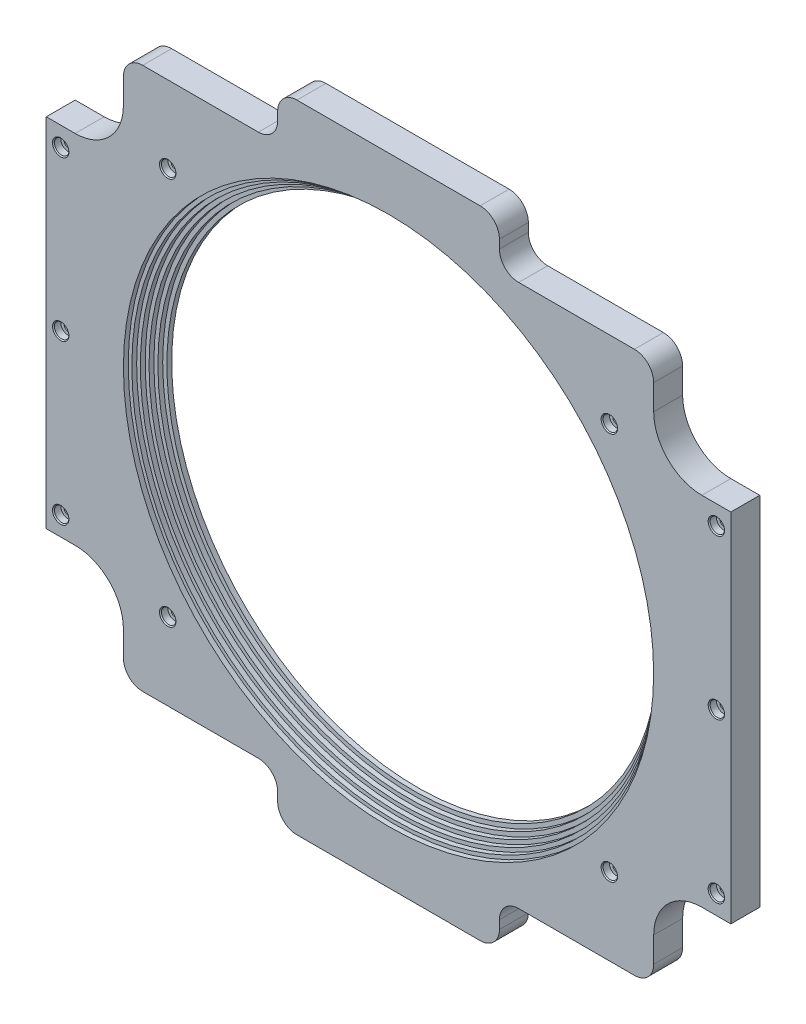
ISO-10303-21;
HEADER;
FILE_DESCRIPTION(('STEP AP214'),'2;1');
FILE_NAME('part.step','',(''),(''),'','','');
FILE_SCHEMA(('AUTOMOTIVE_DESIGN { 1 0 10303 214 1 1 1 1 }'));
ENDSEC;
DATA;
#1=APPLICATION_CONTEXT('core data for automotive mechanical design processes');
#2=APPLICATION_PROTOCOL_DEFINITION('international standard','automotive_design',2000,#1);
#3=PRODUCT_CONTEXT('',#1,'mechanical');
#4=PRODUCT('Part','Part','',(#3));
#5=PRODUCT_RELATED_PRODUCT_CATEGORY('part','',(#4));
#6=PRODUCT_DEFINITION_FORMATION('','',#4);
#7=PRODUCT_DEFINITION_CONTEXT('part definition',#1,'design');
#8=PRODUCT_DEFINITION('design','',#6,#7);
#9=PRODUCT_DEFINITION_SHAPE('','',#8);
#10=(LENGTH_UNIT() NAMED_UNIT(*) SI_UNIT(.MILLI.,.METRE.));
#11=(NAMED_UNIT(*) PLANE_ANGLE_UNIT() SI_UNIT($,.RADIAN.));
#12=(NAMED_UNIT(*) SI_UNIT($,.STERADIAN.) SOLID_ANGLE_UNIT());
#13=UNCERTAINTY_MEASURE_WITH_UNIT(LENGTH_MEASURE(1.E-05),#10,'distance_accuracy_value','');
#14=(GEOMETRIC_REPRESENTATION_CONTEXT(3) GLOBAL_UNCERTAINTY_ASSIGNED_CONTEXT((#13)) GLOBAL_UNIT_ASSIGNED_CONTEXT((#10,
#11,#12)) REPRESENTATION_CONTEXT('',''));
#15=CARTESIAN_POINT('',(0.,0.,0.));
#16=DIRECTION('',(0.,0.,1.));
#17=DIRECTION('',(1.,0.,0.));
#18=AXIS2_PLACEMENT_3D('',#15,#16,#17);
#19=CARTESIAN_POINT('',(0.,0.,168.929283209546));
#20=DIRECTION('',(0.,0.,1.));
#21=DIRECTION('',(1.,0.,0.));
#22=AXIS2_PLACEMENT_3D('',#19,#20,#21);
#23=CYLINDRICAL_SURFACE('',#22,174.596133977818);
#24=CARTESIAN_POINT('',(0.,0.,15.8750000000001));
#25=DIRECTION('',(0.,0.,1.));
#26=DIRECTION('',(1.,0.,0.));
#27=AXIS2_PLACEMENT_3D('',#24,#25,#26);
#28=CIRCLE('',#27,174.596133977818);
#29=CARTESIAN_POINT('',(174.596133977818,0.,15.8750000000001));
#30=VERTEX_POINT('',#29);
#31=EDGE_CURVE('E1602',#30,#30,#28,.T.);
#32=ORIENTED_EDGE('',*,*,#31,.F.);
#33=EDGE_LOOP('',(#32));
#34=FACE_BOUND('',#33,.T.);
#35=CARTESIAN_POINT('',(0.,0.,19.0500000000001));
#36=DIRECTION('',(0.,0.,1.));
#37=DIRECTION('',(1.,0.,0.));
#38=AXIS2_PLACEMENT_3D('',#35,#36,#37);
#39=CIRCLE('',#38,174.596133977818);
#40=CARTESIAN_POINT('',(174.596133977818,0.,19.0500000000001));
#41=VERTEX_POINT('',#40);
#42=EDGE_CURVE('E1605',#41,#41,#39,.T.);
#43=ORIENTED_EDGE('',*,*,#42,.T.);
#44=EDGE_LOOP('',(#43));
#45=FACE_BOUND('',#44,.T.);
#46=ADVANCED_FACE('F33',(#34,#45),#23,.F.);
#47=CARTESIAN_POINT('',(0.,-174.596133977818,15.8750000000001));
#48=DIRECTION('',(0.,0.,-1.));
#49=DIRECTION('',(-1.,0.,0.));
#50=AXIS2_PLACEMENT_3D('',#47,#48,#49);
#51=PLANE('',#50);
#52=CARTESIAN_POINT('',(0.,0.,15.8750000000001));
#53=DIRECTION('',(0.,0.,1.));
#54=DIRECTION('',(1.,0.,0.));
#55=AXIS2_PLACEMENT_3D('',#52,#53,#54);
#56=CIRCLE('',#55,172.24192107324);
#57=CARTESIAN_POINT('',(172.24192107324,0.,15.8750000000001));
#58=VERTEX_POINT('',#57);
#59=EDGE_CURVE('E1599',#58,#58,#56,.T.);
#60=ORIENTED_EDGE('',*,*,#59,.F.);
#61=EDGE_LOOP('',(#60));
#62=FACE_BOUND('',#61,.T.);
#63=ORIENTED_EDGE('',*,*,#31,.T.);
#64=EDGE_LOOP('',(#63));
#65=FACE_BOUND('',#64,.T.);
#66=ADVANCED_FACE('F732',(#62,#65),#51,.F.);
#67=CARTESIAN_POINT('',(0.,0.,168.929283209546));
#68=DIRECTION('',(0.,0.,1.));
#69=DIRECTION('',(1.,0.,0.));
#70=AXIS2_PLACEMENT_3D('',#67,#68,#69);
#71=CYLINDRICAL_SURFACE('',#70,172.24192107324);
#72=CARTESIAN_POINT('',(0.,0.,12.7000000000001));
#73=DIRECTION('',(0.,0.,1.));
#74=DIRECTION('',(1.,0.,0.));
#75=AXIS2_PLACEMENT_3D('',#72,#73,#74);
#76=CIRCLE('',#75,172.24192107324);
#77=CARTESIAN_POINT('',(172.24192107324,0.,12.7000000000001));
#78=VERTEX_POINT('',#77);
#79=EDGE_CURVE('E1596',#78,#78,#76,.T.);
#80=ORIENTED_EDGE('',*,*,#79,.F.);
#81=EDGE_LOOP('',(#80));
#82=FACE_BOUND('',#81,.T.);
#83=ORIENTED_EDGE('',*,*,#59,.T.);
#84=EDGE_LOOP('',(#83));
#85=FACE_BOUND('',#84,.T.);
#86=ADVANCED_FACE('F738',(#82,#85),#71,.F.);
#87=CARTESIAN_POINT('',(0.,-172.24192107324,12.7000000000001));
#88=DIRECTION('',(0.,0.,-1.));
#89=DIRECTION('',(-1.,0.,0.));
#90=AXIS2_PLACEMENT_3D('',#87,#88,#89);
#91=PLANE('',#90);
#92=CARTESIAN_POINT('',(0.,0.,12.7000000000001));
#93=DIRECTION('',(0.,0.,1.));
#94=DIRECTION('',(1.,0.,0.));
#95=AXIS2_PLACEMENT_3D('',#92,#93,#94);
#96=CIRCLE('',#95,169.795722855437);
#97=CARTESIAN_POINT('',(169.795722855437,0.,12.7000000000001));
#98=VERTEX_POINT('',#97);
#99=EDGE_CURVE('E1593',#98,#98,#96,.T.);
#100=ORIENTED_EDGE('',*,*,#99,.F.);
#101=EDGE_LOOP('',(#100));
#102=FACE_BOUND('',#101,.T.);
#103=ORIENTED_EDGE('',*,*,#79,.T.);
#104=EDGE_LOOP('',(#103));
#105=FACE_BOUND('',#104,.T.);
#106=ADVANCED_FACE('F1035',(#102,#105),#91,.F.);
#107=CARTESIAN_POINT('',(0.,0.,168.929283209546));
#108=DIRECTION('',(0.,0.,1.));
#109=DIRECTION('',(1.,0.,0.));
#110=AXIS2_PLACEMENT_3D('',#107,#108,#109);
#111=CYLINDRICAL_SURFACE('',#110,169.795722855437);
#112=CARTESIAN_POINT('',(0.,0.,9.52500000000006));
#113=DIRECTION('',(0.,0.,1.));
#114=DIRECTION('',(1.,0.,0.));
#115=AXIS2_PLACEMENT_3D('',#112,#113,#114);
#116=CIRCLE('',#115,169.795722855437);
#117=CARTESIAN_POINT('',(169.795722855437,0.,9.52500000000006));
#118=VERTEX_POINT('',#117);
#119=EDGE_CURVE('E1590',#118,#118,#116,.T.);
#120=ORIENTED_EDGE('',*,*,#119,.F.);
#121=EDGE_LOOP('',(#120));
#122=FACE_BOUND('',#121,.T.);
#123=ORIENTED_EDGE('',*,*,#99,.T.);
#124=EDGE_LOOP('',(#123));
#125=FACE_BOUND('',#124,.T.);
#126=ADVANCED_FACE('F1044',(#122,#125),#111,.F.);
#127=CARTESIAN_POINT('',(0.,-169.795722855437,9.52500000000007));
#128=DIRECTION('',(0.,0.,-1.));
#129=DIRECTION('',(-1.,0.,0.));
#130=AXIS2_PLACEMENT_3D('',#127,#128,#129);
#131=PLANE('',#130);
#132=CARTESIAN_POINT('',(0.,0.,9.52500000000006));
#133=DIRECTION('',(0.,0.,1.));
#134=DIRECTION('',(1.,0.,0.));
#135=AXIS2_PLACEMENT_3D('',#132,#133,#134);
#136=CIRCLE('',#135,167.253503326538);
#137=CARTESIAN_POINT('',(167.253503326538,0.,9.52500000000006));
#138=VERTEX_POINT('',#137);
#139=EDGE_CURVE('E1587',#138,#138,#136,.T.);
#140=ORIENTED_EDGE('',*,*,#139,.F.);
#141=EDGE_LOOP('',(#140));
#142=FACE_BOUND('',#141,.T.);
#143=ORIENTED_EDGE('',*,*,#119,.T.);
#144=EDGE_LOOP('',(#143));
#145=FACE_BOUND('',#144,.T.);
#146=ADVANCED_FACE('F1054',(#142,#145),#131,.F.);
#147=CARTESIAN_POINT('',(0.,0.,168.929283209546));
#148=DIRECTION('',(0.,0.,1.));
#149=DIRECTION('',(1.,0.,0.));
#150=AXIS2_PLACEMENT_3D('',#147,#148,#149);
#151=CYLINDRICAL_SURFACE('',#150,167.253503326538);
#152=CARTESIAN_POINT('',(0.,0.,6.35000000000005));
#153=DIRECTION('',(0.,0.,1.));
#154=DIRECTION('',(1.,0.,0.));
#155=AXIS2_PLACEMENT_3D('',#152,#153,#154);
#156=CIRCLE('',#155,167.253503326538);
#157=CARTESIAN_POINT('',(167.253503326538,0.,6.35000000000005));
#158=VERTEX_POINT('',#157);
#159=EDGE_CURVE('E1584',#158,#158,#156,.T.);
#160=ORIENTED_EDGE('',*,*,#159,.F.);
#161=EDGE_LOOP('',(#160));
#162=FACE_BOUND('',#161,.T.);
#163=ORIENTED_EDGE('',*,*,#139,.T.);
#164=EDGE_LOOP('',(#163));
#165=FACE_BOUND('',#164,.T.);
#166=ADVANCED_FACE('F1064',(#162,#165),#151,.F.);
#167=CARTESIAN_POINT('',(0.,-167.253503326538,6.35000000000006));
#168=DIRECTION('',(0.,0.,-1.));
#169=DIRECTION('',(-1.,0.,0.));
#170=AXIS2_PLACEMENT_3D('',#167,#168,#169);
#171=PLANE('',#170);
#172=CARTESIAN_POINT('',(0.,0.,6.35000000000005));
#173=DIRECTION('',(0.,0.,1.));
#174=DIRECTION('',(1.,0.,0.));
#175=AXIS2_PLACEMENT_3D('',#172,#173,#174);
#176=CIRCLE('',#175,164.61081373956);
#177=CARTESIAN_POINT('',(164.61081373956,0.,6.35000000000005));
#178=VERTEX_POINT('',#177);
#179=EDGE_CURVE('E1578',#178,#178,#176,.T.);
#180=ORIENTED_EDGE('',*,*,#179,.F.);
#181=EDGE_LOOP('',(#180));
#182=FACE_BOUND('',#181,.T.);
#183=ORIENTED_EDGE('',*,*,#159,.T.);
#184=EDGE_LOOP('',(#183));
#185=FACE_BOUND('',#184,.T.);
#186=ADVANCED_FACE('F1074',(#182,#185),#171,.F.);
#187=CARTESIAN_POINT('',(0.,0.,168.929283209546));
#188=DIRECTION('',(0.,0.,1.));
#189=DIRECTION('',(1.,0.,0.));
#190=AXIS2_PLACEMENT_3D('',#187,#188,#189);
#191=CYLINDRICAL_SURFACE('',#190,164.61081373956);
#192=CARTESIAN_POINT('',(0.,0.,3.17500000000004));
#193=DIRECTION('',(0.,0.,1.));
#194=DIRECTION('',(1.,0.,0.));
#195=AXIS2_PLACEMENT_3D('',#192,#193,#194);
#196=CIRCLE('',#195,164.61081373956);
#197=CARTESIAN_POINT('',(164.61081373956,0.,3.17500000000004));
#198=VERTEX_POINT('',#197);
#199=EDGE_CURVE('E1575',#198,#198,#196,.T.);
#200=ORIENTED_EDGE('',*,*,#199,.F.);
#201=EDGE_LOOP('',(#200));
#202=FACE_BOUND('',#201,.T.);
#203=ORIENTED_EDGE('',*,*,#179,.T.);
#204=EDGE_LOOP('',(#203));
#205=FACE_BOUND('',#204,.T.);
#206=ADVANCED_FACE('F1084',(#202,#205),#191,.F.);
#207=CARTESIAN_POINT('',(0.,-164.61081373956,3.17500000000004));
#208=DIRECTION('',(0.,0.,-1.));
#209=DIRECTION('',(-1.,0.,0.));
#210=AXIS2_PLACEMENT_3D('',#207,#208,#209);
#211=PLANE('',#210);
#212=CARTESIAN_POINT('',(0.,0.,3.17500000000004));
#213=DIRECTION('',(0.,0.,1.));
#214=DIRECTION('',(1.,0.,0.));
#215=AXIS2_PLACEMENT_3D('',#212,#213,#214);
#216=CIRCLE('',#215,161.862733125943);
#217=CARTESIAN_POINT('',(161.862733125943,0.,3.17500000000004));
#218=VERTEX_POINT('',#217);
#219=EDGE_CURVE('E1574',#218,#218,#216,.T.);
#220=ORIENTED_EDGE('',*,*,#219,.F.);
#221=EDGE_LOOP('',(#220));
#222=FACE_BOUND('',#221,.T.);
#223=ORIENTED_EDGE('',*,*,#199,.T.);
#224=EDGE_LOOP('',(#223));
#225=FACE_BOUND('',#224,.T.);
#226=ADVANCED_FACE('F1094',(#222,#225),#211,.F.);
#227=CARTESIAN_POINT('',(0.,0.,168.929283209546));
#228=DIRECTION('',(0.,0.,1.));
#229=DIRECTION('',(1.,0.,0.));
#230=AXIS2_PLACEMENT_3D('',#227,#228,#229);
#231=CYLINDRICAL_SURFACE('',#230,161.862733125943);
#232=CARTESIAN_POINT('',(0.,0.,0.));
#233=DIRECTION('',(0.,0.,1.));
#234=DIRECTION('',(1.,0.,0.));
#235=AXIS2_PLACEMENT_3D('',#232,#233,#234);
#236=CIRCLE('',#235,161.862733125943);
#237=CARTESIAN_POINT('',(161.862733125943,0.,0.));
#238=VERTEX_POINT('',#237);
#239=EDGE_CURVE('E1571',#238,#238,#236,.T.);
#240=ORIENTED_EDGE('',*,*,#239,.F.);
#241=EDGE_LOOP('',(#240));
#242=FACE_BOUND('',#241,.T.);
#243=ORIENTED_EDGE('',*,*,#219,.T.);
#244=EDGE_LOOP('',(#243));
#245=FACE_BOUND('',#244,.T.);
#246=ADVANCED_FACE('F949',(#242,#245),#231,.F.);
#247=CARTESIAN_POINT('',(-174.625,-209.55,0.));
#248=DIRECTION('',(1.,0.,0.));
#249=DIRECTION('',(0.,1.,0.));
#250=AXIS2_PLACEMENT_3D('',#247,#248,#249);
#251=PLANE('',#250);
#252=DIRECTION('',(0.,0.,1.));
#253=VECTOR('',#252,1.);
#254=CARTESIAN_POINT('',(-174.625,-165.862,0.));
#255=LINE('',#254,#253);
#256=CARTESIAN_POINT('',(-174.625,-165.862,0.));
#257=VERTEX_POINT('',#256);
#258=CARTESIAN_POINT('',(-174.625,-165.862,19.05));
#259=VERTEX_POINT('',#258);
#260=EDGE_CURVE('E312',#257,#259,#255,.T.);
#261=ORIENTED_EDGE('',*,*,#260,.T.);
#262=DIRECTION('',(0.,1.,0.));
#263=VECTOR('',#262,1.);
#264=CARTESIAN_POINT('',(-174.625,-209.55,19.05));
#265=LINE('',#264,#263);
#266=CARTESIAN_POINT('',(-174.625,-149.225,19.05));
#267=VERTEX_POINT('',#266);
#268=EDGE_CURVE('E503',#259,#267,#265,.T.);
#269=ORIENTED_EDGE('',*,*,#268,.T.);
#270=DIRECTION('',(0.,0.,1.));
#271=VECTOR('',#270,1.);
#272=CARTESIAN_POINT('',(-174.625,-149.225,0.));
#273=LINE('',#272,#271);
#274=CARTESIAN_POINT('',(-174.625,-149.225,0.));
#275=VERTEX_POINT('',#274);
#276=EDGE_CURVE('E514',#275,#267,#273,.T.);
#277=ORIENTED_EDGE('',*,*,#276,.F.);
#278=DIRECTION('',(0.,1.,0.));
#279=VECTOR('',#278,1.);
#280=CARTESIAN_POINT('',(-174.625,-209.55,0.));
#281=LINE('',#280,#279);
#282=EDGE_CURVE('E506',#257,#275,#281,.T.);
#283=ORIENTED_EDGE('',*,*,#282,.F.);
#284=EDGE_LOOP('',(#261,#269,#277,#283));
#285=FACE_BOUND('',#284,.T.);
#286=ADVANCED_FACE('F946',(#285),#251,.F.);
#287=CARTESIAN_POINT('',(174.625,209.55,0.));
#288=DIRECTION('',(-1.,0.,0.));
#289=DIRECTION('',(0.,0.,1.));
#290=AXIS2_PLACEMENT_3D('',#287,#288,#289);
#291=PLANE('',#290);
#292=DIRECTION('',(0.,0.,1.));
#293=VECTOR('',#292,1.);
#294=CARTESIAN_POINT('',(174.625,165.862,0.));
#295=LINE('',#294,#293);
#296=CARTESIAN_POINT('',(174.625,165.862,0.));
#297=VERTEX_POINT('',#296);
#298=CARTESIAN_POINT('',(174.625,165.862,19.05));
#299=VERTEX_POINT('',#298);
#300=EDGE_CURVE('E371',#297,#299,#295,.T.);
#301=ORIENTED_EDGE('',*,*,#300,.T.);
#302=DIRECTION('',(0.,-1.,0.));
#303=VECTOR('',#302,1.);
#304=CARTESIAN_POINT('',(174.625,209.55,19.05));
#305=LINE('',#304,#303);
#306=CARTESIAN_POINT('',(174.625,149.225,19.05));
#307=VERTEX_POINT('',#306);
#308=EDGE_CURVE('E526',#299,#307,#305,.T.);
#309=ORIENTED_EDGE('',*,*,#308,.T.);
#310=DIRECTION('',(0.,0.,1.));
#311=VECTOR('',#310,1.);
#312=CARTESIAN_POINT('',(174.625,149.225,0.));
#313=LINE('',#312,#311);
#314=CARTESIAN_POINT('',(174.625,149.225,0.));
#315=VERTEX_POINT('',#314);
#316=EDGE_CURVE('E537',#315,#307,#313,.T.);
#317=ORIENTED_EDGE('',*,*,#316,.F.);
#318=DIRECTION('',(0.,-1.,0.));
#319=VECTOR('',#318,1.);
#320=CARTESIAN_POINT('',(174.625,209.55,0.));
#321=LINE('',#320,#319);
#322=EDGE_CURVE('E529',#297,#315,#321,.T.);
#323=ORIENTED_EDGE('',*,*,#322,.F.);
#324=EDGE_LOOP('',(#301,#309,#317,#323));
#325=FACE_BOUND('',#324,.T.);
#326=ADVANCED_FACE('F682',(#325),#291,.F.);
#327=CARTESIAN_POINT('',(225.425,-209.55,0.));
#328=DIRECTION('',(0.,0.,-1.));
#329=DIRECTION('',(-1.,0.,0.));
#330=AXIS2_PLACEMENT_3D('',#327,#328,#329);
#331=PLANE('',#330);
#332=ORIENTED_EDGE('',*,*,#239,.T.);
#333=EDGE_LOOP('',(#332));
#334=FACE_BOUND('',#333,.T.);
#335=CARTESIAN_POINT('',(-145.415,-127.762,0.));
#336=DIRECTION('',(0.,0.,1.));
#337=DIRECTION('',(1.,0.,0.));
#338=AXIS2_PLACEMENT_3D('',#335,#336,#337);
#339=CIRCLE('',#338,2.55269999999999);
#340=CARTESIAN_POINT('',(-142.8623,-127.762,0.));
#341=VERTEX_POINT('',#340);
#342=EDGE_CURVE('E1620',#341,#341,#339,.T.);
#343=ORIENTED_EDGE('',*,*,#342,.T.);
#344=EDGE_LOOP('',(#343));
#345=FACE_BOUND('',#344,.T.);
#346=CARTESIAN_POINT('',(145.415,-127.762,0.));
#347=DIRECTION('',(0.,0.,1.));
#348=DIRECTION('',(1.,0.,0.));
#349=AXIS2_PLACEMENT_3D('',#346,#347,#348);
#350=CIRCLE('',#349,2.55269999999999);
#351=CARTESIAN_POINT('',(147.9677,-127.762,0.));
#352=VERTEX_POINT('',#351);
#353=EDGE_CURVE('E1635',#352,#352,#350,.T.);
#354=ORIENTED_EDGE('',*,*,#353,.T.);
#355=EDGE_LOOP('',(#354));
#356=FACE_BOUND('',#355,.T.);
#357=CARTESIAN_POINT('',(145.415,127.762,0.));
#358=DIRECTION('',(0.,0.,1.));
#359=DIRECTION('',(1.,0.,0.));
#360=AXIS2_PLACEMENT_3D('',#357,#358,#359);
#361=CIRCLE('',#360,2.55269999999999);
#362=CARTESIAN_POINT('',(147.9677,127.762,0.));
#363=VERTEX_POINT('',#362);
#364=EDGE_CURVE('E1650',#363,#363,#361,.T.);
#365=ORIENTED_EDGE('',*,*,#364,.T.);
#366=EDGE_LOOP('',(#365));
#367=FACE_BOUND('',#366,.T.);
#368=CARTESIAN_POINT('',(-145.415,127.762,0.));
#369=DIRECTION('',(0.,0.,1.));
#370=DIRECTION('',(1.,0.,0.));
#371=AXIS2_PLACEMENT_3D('',#368,#369,#370);
#372=CIRCLE('',#371,2.55269999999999);
#373=CARTESIAN_POINT('',(-142.8623,127.762,0.));
#374=VERTEX_POINT('',#373);
#375=EDGE_CURVE('E300',#374,#374,#372,.T.);
#376=ORIENTED_EDGE('',*,*,#375,.T.);
#377=EDGE_LOOP('',(#376));
#378=FACE_BOUND('',#377,.T.);
#379=DIRECTION('',(1.,0.,0.));
#380=VECTOR('',#379,1.);
#381=CARTESIAN_POINT('',(225.425,-209.55,0.));
#382=LINE('',#381,#380);
#383=CARTESIAN_POINT('',(-60.325,-209.55,0.));
#384=VERTEX_POINT('',#383);
#385=CARTESIAN_POINT('',(60.325,-209.55,0.));
#386=VERTEX_POINT('',#385);
#387=EDGE_CURVE('E589',#384,#386,#382,.T.);
#388=ORIENTED_EDGE('',*,*,#387,.F.);
#389=CARTESIAN_POINT('',(-60.3250000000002,-196.85,0.));
#390=DIRECTION('',(0.,0.,-1.));
#391=DIRECTION('',(-1.,0.,0.));
#392=AXIS2_PLACEMENT_3D('',#389,#390,#391);
#393=CIRCLE('',#392,12.7);
#394=CARTESIAN_POINT('',(-73.0250000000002,-196.85,0.));
#395=VERTEX_POINT('',#394);
#396=EDGE_CURVE('E637',#384,#395,#393,.T.);
#397=ORIENTED_EDGE('',*,*,#396,.T.);
#398=DIRECTION('',(0.,1.,0.));
#399=VECTOR('',#398,1.);
#400=CARTESIAN_POINT('',(-73.0250000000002,-191.262,0.));
#401=LINE('',#400,#399);
#402=CARTESIAN_POINT('',(-73.0250000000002,-191.262,0.));
#403=VERTEX_POINT('',#402);
#404=EDGE_CURVE('E281',#395,#403,#401,.T.);
#405=ORIENTED_EDGE('',*,*,#404,.T.);
#406=CARTESIAN_POINT('',(-85.7250000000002,-191.262,0.));
#407=DIRECTION('',(0.,0.,1.));
#408=DIRECTION('',(1.,0.,0.));
#409=AXIS2_PLACEMENT_3D('',#406,#407,#408);
#410=CIRCLE('',#409,12.7);
#411=CARTESIAN_POINT('',(-85.7250000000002,-178.562,0.));
#412=VERTEX_POINT('',#411);
#413=EDGE_CURVE('E274',#403,#412,#410,.T.);
#414=ORIENTED_EDGE('',*,*,#413,.T.);
#415=DIRECTION('',(-1.,0.,0.));
#416=VECTOR('',#415,1.);
#417=CARTESIAN_POINT('',(-161.925,-178.562,0.));
#418=LINE('',#417,#416);
#419=CARTESIAN_POINT('',(-161.925,-178.562,0.));
#420=VERTEX_POINT('',#419);
#421=EDGE_CURVE('E284',#412,#420,#418,.T.);
#422=ORIENTED_EDGE('',*,*,#421,.T.);
#423=CARTESIAN_POINT('',(-161.925,-165.862,0.));
#424=DIRECTION('',(0.,0.,-1.));
#425=DIRECTION('',(-1.,0.,0.));
#426=AXIS2_PLACEMENT_3D('',#423,#424,#425);
#427=CIRCLE('',#426,12.7);
#428=EDGE_CURVE('E288',#420,#257,#427,.T.);
#429=ORIENTED_EDGE('',*,*,#428,.T.);
#430=ORIENTED_EDGE('',*,*,#282,.T.);
#431=CARTESIAN_POINT('',(-206.375,-149.225,0.));
#432=DIRECTION('',(0.,0.,1.));
#433=DIRECTION('',(1.,0.,0.));
#434=AXIS2_PLACEMENT_3D('',#431,#432,#433);
#435=CIRCLE('',#434,31.75);
#436=CARTESIAN_POINT('',(-206.375,-117.475,0.));
#437=VERTEX_POINT('',#436);
#438=EDGE_CURVE('E499',#275,#437,#435,.T.);
#439=ORIENTED_EDGE('',*,*,#438,.T.);
#440=DIRECTION('',(-1.,0.,0.));
#441=VECTOR('',#440,1.);
#442=CARTESIAN_POINT('',(-206.375,-117.475,0.));
#443=LINE('',#442,#441);
#444=CARTESIAN_POINT('',(-225.425,-117.475,0.));
#445=VERTEX_POINT('',#444);
#446=EDGE_CURVE('E502',#437,#445,#443,.T.);
#447=ORIENTED_EDGE('',*,*,#446,.T.);
#448=DIRECTION('',(0.,-1.,0.));
#449=VECTOR('',#448,1.);
#450=CARTESIAN_POINT('',(-225.425,-209.55,0.));
#451=LINE('',#450,#449);
#452=CARTESIAN_POINT('',(-225.425,117.475,0.));
#453=VERTEX_POINT('',#452);
#454=EDGE_CURVE('E597',#453,#445,#451,.T.);
#455=ORIENTED_EDGE('',*,*,#454,.F.);
#456=DIRECTION('',(1.,0.,0.));
#457=VECTOR('',#456,1.);
#458=CARTESIAN_POINT('',(-206.375,117.475,0.));
#459=LINE('',#458,#457);
#460=CARTESIAN_POINT('',(-206.375,117.475,0.));
#461=VERTEX_POINT('',#460);
#462=EDGE_CURVE('E569',#453,#461,#459,.T.);
#463=ORIENTED_EDGE('',*,*,#462,.T.);
#464=CARTESIAN_POINT('',(-206.375,149.225,0.));
#465=DIRECTION('',(0.,0.,1.));
#466=DIRECTION('',(-1.,0.,0.));
#467=AXIS2_PLACEMENT_3D('',#464,#465,#466);
#468=CIRCLE('',#467,31.75);
#469=CARTESIAN_POINT('',(-174.625,149.225,0.));
#470=VERTEX_POINT('',#469);
#471=EDGE_CURVE('E572',#461,#470,#468,.T.);
#472=ORIENTED_EDGE('',*,*,#471,.T.);
#473=DIRECTION('',(0.,1.,0.));
#474=VECTOR('',#473,1.);
#475=CARTESIAN_POINT('',(-174.625,209.55,0.));
#476=LINE('',#475,#474);
#477=CARTESIAN_POINT('',(-174.625,165.862,0.));
#478=VERTEX_POINT('',#477);
#479=EDGE_CURVE('E576',#470,#478,#476,.T.);
#480=ORIENTED_EDGE('',*,*,#479,.T.);
#481=CARTESIAN_POINT('',(-161.925,165.862,0.));
#482=DIRECTION('',(0.,0.,-1.));
#483=DIRECTION('',(1.,0.,0.));
#484=AXIS2_PLACEMENT_3D('',#481,#482,#483);
#485=CIRCLE('',#484,12.7);
#486=CARTESIAN_POINT('',(-161.925,178.562,0.));
#487=VERTEX_POINT('',#486);
#488=EDGE_CURVE('E377',#478,#487,#485,.T.);
#489=ORIENTED_EDGE('',*,*,#488,.T.);
#490=DIRECTION('',(1.,0.,0.));
#491=VECTOR('',#490,1.);
#492=CARTESIAN_POINT('',(-161.925,178.562,0.));
#493=LINE('',#492,#491);
#494=CARTESIAN_POINT('',(-85.7250000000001,178.562,0.));
#495=VERTEX_POINT('',#494);
#496=EDGE_CURVE('E380',#487,#495,#493,.T.);
#497=ORIENTED_EDGE('',*,*,#496,.T.);
#498=CARTESIAN_POINT('',(-85.7250000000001,191.262,0.));
#499=DIRECTION('',(0.,0.,1.));
#500=DIRECTION('',(-1.,0.,0.));
#501=AXIS2_PLACEMENT_3D('',#498,#499,#500);
#502=CIRCLE('',#501,12.7);
#503=CARTESIAN_POINT('',(-73.0250000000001,191.262,0.));
#504=VERTEX_POINT('',#503);
#505=EDGE_CURVE('E384',#495,#504,#502,.T.);
#506=ORIENTED_EDGE('',*,*,#505,.T.);
#507=DIRECTION('',(0.,1.,0.));
#508=VECTOR('',#507,1.);
#509=CARTESIAN_POINT('',(-73.0250000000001,191.262,0.));
#510=LINE('',#509,#508);
#511=CARTESIAN_POINT('',(-73.0250000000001,196.85,0.));
#512=VERTEX_POINT('',#511);
#513=EDGE_CURVE('E387',#504,#512,#510,.T.);
#514=ORIENTED_EDGE('',*,*,#513,.T.);
#515=CARTESIAN_POINT('',(-60.3250000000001,196.85,0.));
#516=DIRECTION('',(0.,0.,-1.));
#517=DIRECTION('',(-1.,0.,0.));
#518=AXIS2_PLACEMENT_3D('',#515,#516,#517);
#519=CIRCLE('',#518,12.7);
#520=CARTESIAN_POINT('',(-60.325,209.55,0.));
#521=VERTEX_POINT('',#520);
#522=EDGE_CURVE('E633',#512,#521,#519,.T.);
#523=ORIENTED_EDGE('',*,*,#522,.T.);
#524=DIRECTION('',(-1.,0.,0.));
#525=VECTOR('',#524,1.);
#526=CARTESIAN_POINT('',(225.425,209.55,0.));
#527=LINE('',#526,#525);
#528=CARTESIAN_POINT('',(60.3250000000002,209.55,0.));
#529=VERTEX_POINT('',#528);
#530=EDGE_CURVE('E612',#529,#521,#527,.T.);
#531=ORIENTED_EDGE('',*,*,#530,.F.);
#532=CARTESIAN_POINT('',(60.3250000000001,196.85,0.));
#533=DIRECTION('',(0.,0.,-1.));
#534=DIRECTION('',(-1.,0.,0.));
#535=AXIS2_PLACEMENT_3D('',#532,#533,#534);
#536=CIRCLE('',#535,12.7);
#537=CARTESIAN_POINT('',(73.0250000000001,196.85,0.));
#538=VERTEX_POINT('',#537);
#539=EDGE_CURVE('E56',#529,#538,#536,.T.);
#540=ORIENTED_EDGE('',*,*,#539,.T.);
#541=DIRECTION('',(0.,-1.,0.));
#542=VECTOR('',#541,1.);
#543=CARTESIAN_POINT('',(73.0250000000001,191.262,0.));
#544=LINE('',#543,#542);
#545=CARTESIAN_POINT('',(73.0250000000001,191.262,0.));
#546=VERTEX_POINT('',#545);
#547=EDGE_CURVE('E356',#538,#546,#544,.T.);
#548=ORIENTED_EDGE('',*,*,#547,.T.);
#549=CARTESIAN_POINT('',(85.7250000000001,191.262,0.));
#550=DIRECTION('',(0.,0.,1.));
#551=DIRECTION('',(1.,0.,0.));
#552=AXIS2_PLACEMENT_3D('',#549,#550,#551);
#553=CIRCLE('',#552,12.7);
#554=CARTESIAN_POINT('',(85.7250000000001,178.562,0.));
#555=VERTEX_POINT('',#554);
#556=EDGE_CURVE('E346',#546,#555,#553,.T.);
#557=ORIENTED_EDGE('',*,*,#556,.T.);
#558=DIRECTION('',(1.,0.,0.));
#559=VECTOR('',#558,1.);
#560=CARTESIAN_POINT('',(161.925,178.562,0.));
#561=LINE('',#560,#559);
#562=CARTESIAN_POINT('',(161.925,178.562,0.));
#563=VERTEX_POINT('',#562);
#564=EDGE_CURVE('E349',#555,#563,#561,.T.);
#565=ORIENTED_EDGE('',*,*,#564,.T.);
#566=CARTESIAN_POINT('',(161.925,165.862,0.));
#567=DIRECTION('',(0.,0.,-1.));
#568=DIRECTION('',(-1.,0.,0.));
#569=AXIS2_PLACEMENT_3D('',#566,#567,#568);
#570=CIRCLE('',#569,12.7);
#571=EDGE_CURVE('E353',#563,#297,#570,.T.);
#572=ORIENTED_EDGE('',*,*,#571,.T.);
#573=ORIENTED_EDGE('',*,*,#322,.T.);
#574=CARTESIAN_POINT('',(206.375,149.225,0.));
#575=DIRECTION('',(0.,0.,1.));
#576=DIRECTION('',(1.,0.,0.));
#577=AXIS2_PLACEMENT_3D('',#574,#575,#576);
#578=CIRCLE('',#577,31.75);
#579=CARTESIAN_POINT('',(206.375,117.475,0.));
#580=VERTEX_POINT('',#579);
#581=EDGE_CURVE('E522',#315,#580,#578,.T.);
#582=ORIENTED_EDGE('',*,*,#581,.T.);
#583=DIRECTION('',(1.,0.,0.));
#584=VECTOR('',#583,1.);
#585=CARTESIAN_POINT('',(206.375,117.475,0.));
#586=LINE('',#585,#584);
#587=CARTESIAN_POINT('',(225.425,117.475,0.));
#588=VERTEX_POINT('',#587);
#589=EDGE_CURVE('E525',#580,#588,#586,.T.);
#590=ORIENTED_EDGE('',*,*,#589,.T.);
#591=DIRECTION('',(0.,1.,0.));
#592=VECTOR('',#591,1.);
#593=CARTESIAN_POINT('',(225.425,-209.55,0.));
#594=LINE('',#593,#592);
#595=CARTESIAN_POINT('',(225.425,-117.475,0.));
#596=VERTEX_POINT('',#595);
#597=EDGE_CURVE('E609',#596,#588,#594,.T.);
#598=ORIENTED_EDGE('',*,*,#597,.F.);
#599=DIRECTION('',(-1.,0.,0.));
#600=VECTOR('',#599,1.);
#601=CARTESIAN_POINT('',(206.375,-117.475,0.));
#602=LINE('',#601,#600);
#603=CARTESIAN_POINT('',(206.375,-117.475,0.));
#604=VERTEX_POINT('',#603);
#605=EDGE_CURVE('E552',#596,#604,#602,.T.);
#606=ORIENTED_EDGE('',*,*,#605,.T.);
#607=CARTESIAN_POINT('',(206.375,-149.225,0.));
#608=DIRECTION('',(0.,0.,1.));
#609=DIRECTION('',(-1.,0.,0.));
#610=AXIS2_PLACEMENT_3D('',#607,#608,#609);
#611=CIRCLE('',#610,31.75);
#612=CARTESIAN_POINT('',(174.625,-149.225,0.));
#613=VERTEX_POINT('',#612);
#614=EDGE_CURVE('E545',#604,#613,#611,.T.);
#615=ORIENTED_EDGE('',*,*,#614,.T.);
#616=DIRECTION('',(0.,-1.,0.));
#617=VECTOR('',#616,1.);
#618=CARTESIAN_POINT('',(174.625,-209.55,0.));
#619=LINE('',#618,#617);
#620=CARTESIAN_POINT('',(174.625,-165.862,0.));
#621=VERTEX_POINT('',#620);
#622=EDGE_CURVE('E548',#613,#621,#619,.T.);
#623=ORIENTED_EDGE('',*,*,#622,.T.);
#624=CARTESIAN_POINT('',(161.925,-165.862,0.));
#625=DIRECTION('',(0.,0.,-1.));
#626=DIRECTION('',(1.,0.,0.));
#627=AXIS2_PLACEMENT_3D('',#624,#625,#626);
#628=CIRCLE('',#627,12.7);
#629=CARTESIAN_POINT('',(161.925,-178.562,0.));
#630=VERTEX_POINT('',#629);
#631=EDGE_CURVE('E316',#621,#630,#628,.T.);
#632=ORIENTED_EDGE('',*,*,#631,.T.);
#633=DIRECTION('',(-1.,0.,0.));
#634=VECTOR('',#633,1.);
#635=CARTESIAN_POINT('',(161.925,-178.562,0.));
#636=LINE('',#635,#634);
#637=CARTESIAN_POINT('',(85.7249999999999,-178.562,0.));
#638=VERTEX_POINT('',#637);
#639=EDGE_CURVE('E319',#630,#638,#636,.T.);
#640=ORIENTED_EDGE('',*,*,#639,.T.);
#641=CARTESIAN_POINT('',(85.7249999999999,-191.262,0.));
#642=DIRECTION('',(0.,0.,1.));
#643=DIRECTION('',(-1.,0.,0.));
#644=AXIS2_PLACEMENT_3D('',#641,#642,#643);
#645=CIRCLE('',#644,12.7);
#646=CARTESIAN_POINT('',(73.0249999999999,-191.262,0.));
#647=VERTEX_POINT('',#646);
#648=EDGE_CURVE('E323',#638,#647,#645,.T.);
#649=ORIENTED_EDGE('',*,*,#648,.T.);
#650=DIRECTION('',(0.,-1.,0.));
#651=VECTOR('',#650,1.);
#652=CARTESIAN_POINT('',(73.0249999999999,-191.262,0.));
#653=LINE('',#652,#651);
#654=CARTESIAN_POINT('',(73.0249999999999,-196.85,0.));
#655=VERTEX_POINT('',#654);
#656=EDGE_CURVE('E326',#647,#655,#653,.T.);
#657=ORIENTED_EDGE('',*,*,#656,.T.);
#658=CARTESIAN_POINT('',(60.3249999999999,-196.85,0.));
#659=DIRECTION('',(0.,0.,-1.));
#660=DIRECTION('',(-1.,0.,0.));
#661=AXIS2_PLACEMENT_3D('',#658,#659,#660);
#662=CIRCLE('',#661,12.7);
#663=EDGE_CURVE('E635',#655,#386,#662,.T.);
#664=ORIENTED_EDGE('',*,*,#663,.T.);
#665=EDGE_LOOP('',(#388,#397,#405,#414,#422,#429,#430,#439,#447,#455,#463,#472,#480,#489,#497,
#506,#514,#523,#531,#540,#548,#557,#565,#572,#573,#582,#590,#598,#606,#615,#623,#632,#640,#649,
#657,#664));
#666=FACE_BOUND('',#665,.T.);
#667=CARTESIAN_POINT('',(-215.9,-104.775,0.));
#668=DIRECTION('',(0.,0.,1.));
#669=DIRECTION('',(1.,0.,0.));
#670=AXIS2_PLACEMENT_3D('',#667,#668,#669);
#671=CIRCLE('',#670,2.55269999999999);
#672=CARTESIAN_POINT('',(-213.3473,-104.775,0.));
#673=VERTEX_POINT('',#672);
#674=EDGE_CURVE('E403',#673,#673,#671,.T.);
#675=ORIENTED_EDGE('',*,*,#674,.T.);
#676=EDGE_LOOP('',(#675));
#677=FACE_BOUND('',#676,.T.);
#678=CARTESIAN_POINT('',(-215.9,104.775,0.));
#679=DIRECTION('',(0.,0.,1.));
#680=DIRECTION('',(1.,0.,0.));
#681=AXIS2_PLACEMENT_3D('',#678,#679,#680);
#682=CIRCLE('',#681,2.55269999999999);
#683=CARTESIAN_POINT('',(-213.3473,104.775,0.));
#684=VERTEX_POINT('',#683);
#685=EDGE_CURVE('E423',#684,#684,#682,.T.);
#686=ORIENTED_EDGE('',*,*,#685,.T.);
#687=EDGE_LOOP('',(#686));
#688=FACE_BOUND('',#687,.T.);
#689=CARTESIAN_POINT('',(215.9,104.775,0.));
#690=DIRECTION('',(0.,0.,1.));
#691=DIRECTION('',(1.,0.,0.));
#692=AXIS2_PLACEMENT_3D('',#689,#690,#691);
#693=CIRCLE('',#692,2.55269999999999);
#694=CARTESIAN_POINT('',(218.4527,104.775,0.));
#695=VERTEX_POINT('',#694);
#696=EDGE_CURVE('E438',#695,#695,#693,.T.);
#697=ORIENTED_EDGE('',*,*,#696,.T.);
#698=EDGE_LOOP('',(#697));
#699=FACE_BOUND('',#698,.T.);
#700=CARTESIAN_POINT('',(215.9,-104.775,0.));
#701=DIRECTION('',(0.,0.,1.));
#702=DIRECTION('',(1.,0.,0.));
#703=AXIS2_PLACEMENT_3D('',#700,#701,#702);
#704=CIRCLE('',#703,2.55269999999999);
#705=CARTESIAN_POINT('',(218.4527,-104.775,0.));
#706=VERTEX_POINT('',#705);
#707=EDGE_CURVE('E453',#706,#706,#704,.T.);
#708=ORIENTED_EDGE('',*,*,#707,.T.);
#709=EDGE_LOOP('',(#708));
#710=FACE_BOUND('',#709,.T.);
#711=CARTESIAN_POINT('',(215.9,0.,0.));
#712=DIRECTION('',(0.,0.,1.));
#713=DIRECTION('',(1.,0.,0.));
#714=AXIS2_PLACEMENT_3D('',#711,#712,#713);
#715=CIRCLE('',#714,2.55269999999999);
#716=CARTESIAN_POINT('',(218.4527,0.,0.));
#717=VERTEX_POINT('',#716);
#718=EDGE_CURVE('E483',#717,#717,#715,.T.);
#719=ORIENTED_EDGE('',*,*,#718,.T.);
#720=EDGE_LOOP('',(#719));
#721=FACE_BOUND('',#720,.T.);
#722=CARTESIAN_POINT('',(-215.9,0.,0.));
#723=DIRECTION('',(0.,0.,1.));
#724=DIRECTION('',(1.,0.,0.));
#725=AXIS2_PLACEMENT_3D('',#722,#723,#724);
#726=CIRCLE('',#725,2.55269999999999);
#727=CARTESIAN_POINT('',(-213.3473,0.,0.));
#728=VERTEX_POINT('',#727);
#729=EDGE_CURVE('E468',#728,#728,#726,.T.);
#730=ORIENTED_EDGE('',*,*,#729,.T.);
#731=EDGE_LOOP('',(#730));
#732=FACE_BOUND('',#731,.T.);
#733=ADVANCED_FACE('F291',(#334,#345,#356,#367,#378,#666,#677,#688,#699,#710,#721,#732),#331,.T.);
#734=CARTESIAN_POINT('',(225.425,-209.55,19.05));
#735=DIRECTION('',(0.,1.,0.));
#736=DIRECTION('',(-1.,0.,0.));
#737=AXIS2_PLACEMENT_3D('',#734,#735,#736);
#738=PLANE('',#737);
#739=DIRECTION('',(1.,0.,0.));
#740=VECTOR('',#739,1.);
#741=CARTESIAN_POINT('',(225.425,-209.55,19.05));
#742=LINE('',#741,#740);
#743=CARTESIAN_POINT('',(-60.325,-209.55,19.05));
#744=VERTEX_POINT('',#743);
#745=CARTESIAN_POINT('',(60.325,-209.55,19.05));
#746=VERTEX_POINT('',#745);
#747=EDGE_CURVE('E593',#744,#746,#742,.T.);
#748=ORIENTED_EDGE('',*,*,#747,.F.);
#749=DIRECTION('',(0.,0.,1.));
#750=VECTOR('',#749,1.);
#751=CARTESIAN_POINT('',(-60.3250000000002,-209.55,19.05));
#752=LINE('',#751,#750);
#753=EDGE_CURVE('E630',#744,#384,#752,.F.);
#754=ORIENTED_EDGE('',*,*,#753,.T.);
#755=ORIENTED_EDGE('',*,*,#387,.T.);
#756=DIRECTION('',(0.,0.,1.));
#757=VECTOR('',#756,1.);
#758=CARTESIAN_POINT('',(60.3249999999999,-209.55,19.05));
#759=LINE('',#758,#757);
#760=EDGE_CURVE('E627',#386,#746,#759,.T.);
#761=ORIENTED_EDGE('',*,*,#760,.T.);
#762=EDGE_LOOP('',(#748,#754,#755,#761));
#763=FACE_BOUND('',#762,.T.);
#764=ADVANCED_FACE('F989',(#763),#738,.F.);
#765=CARTESIAN_POINT('',(225.425,-209.55,19.05));
#766=DIRECTION('',(-1.,0.,0.));
#767=DIRECTION('',(0.,-1.,0.));
#768=AXIS2_PLACEMENT_3D('',#765,#766,#767);
#769=PLANE('',#768);
#770=ORIENTED_EDGE('',*,*,#597,.T.);
#771=DIRECTION('',(0.,0.,1.));
#772=VECTOR('',#771,1.);
#773=CARTESIAN_POINT('',(225.425,117.475,0.));
#774=LINE('',#773,#772);
#775=CARTESIAN_POINT('',(225.425,117.475,19.05));
#776=VERTEX_POINT('',#775);
#777=EDGE_CURVE('E541',#588,#776,#774,.T.);
#778=ORIENTED_EDGE('',*,*,#777,.T.);
#779=DIRECTION('',(0.,1.,0.));
#780=VECTOR('',#779,1.);
#781=CARTESIAN_POINT('',(225.425,-209.55,19.05));
#782=LINE('',#781,#780);
#783=CARTESIAN_POINT('',(225.425,-117.475,19.05));
#784=VERTEX_POINT('',#783);
#785=EDGE_CURVE('E596',#784,#776,#782,.T.);
#786=ORIENTED_EDGE('',*,*,#785,.F.);
#787=DIRECTION('',(0.,0.,1.));
#788=VECTOR('',#787,1.);
#789=CARTESIAN_POINT('',(225.425,-117.475,0.));
#790=LINE('',#789,#788);
#791=EDGE_CURVE('E566',#596,#784,#790,.T.);
#792=ORIENTED_EDGE('',*,*,#791,.F.);
#793=EDGE_LOOP('',(#770,#778,#786,#792));
#794=FACE_BOUND('',#793,.T.);
#795=ADVANCED_FACE('F693',(#794),#769,.F.);
#796=CARTESIAN_POINT('',(225.425,209.55,19.05));
#797=DIRECTION('',(0.,-1.,0.));
#798=DIRECTION('',(1.,0.,0.));
#799=AXIS2_PLACEMENT_3D('',#796,#797,#798);
#800=PLANE('',#799);
#801=ORIENTED_EDGE('',*,*,#530,.T.);
#802=DIRECTION('',(0.,0.,1.));
#803=VECTOR('',#802,1.);
#804=CARTESIAN_POINT('',(-60.3250000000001,209.55,19.05));
#805=LINE('',#804,#803);
#806=CARTESIAN_POINT('',(-60.325,209.55,19.05));
#807=VERTEX_POINT('',#806);
#808=EDGE_CURVE('E642',#521,#807,#805,.T.);
#809=ORIENTED_EDGE('',*,*,#808,.T.);
#810=DIRECTION('',(-1.,0.,0.));
#811=VECTOR('',#810,1.);
#812=CARTESIAN_POINT('',(225.425,209.55,19.05));
#813=LINE('',#812,#811);
#814=CARTESIAN_POINT('',(60.3250000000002,209.55,19.05));
#815=VERTEX_POINT('',#814);
#816=EDGE_CURVE('E600',#815,#807,#813,.T.);
#817=ORIENTED_EDGE('',*,*,#816,.F.);
#818=DIRECTION('',(0.,0.,1.));
#819=VECTOR('',#818,1.);
#820=CARTESIAN_POINT('',(60.3250000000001,209.55,19.05));
#821=LINE('',#820,#819);
#822=EDGE_CURVE('E640',#815,#529,#821,.F.);
#823=ORIENTED_EDGE('',*,*,#822,.T.);
#824=EDGE_LOOP('',(#801,#809,#817,#823));
#825=FACE_BOUND('',#824,.T.);
#826=ADVANCED_FACE('F656',(#825),#800,.F.);
#827=CARTESIAN_POINT('',(-225.425,-209.55,19.05));
#828=DIRECTION('',(1.,0.,0.));
#829=DIRECTION('',(0.,1.,0.));
#830=AXIS2_PLACEMENT_3D('',#827,#828,#829);
#831=PLANE('',#830);
#832=ORIENTED_EDGE('',*,*,#454,.T.);
#833=DIRECTION('',(0.,0.,1.));
#834=VECTOR('',#833,1.);
#835=CARTESIAN_POINT('',(-225.425,-117.475,0.));
#836=LINE('',#835,#834);
#837=CARTESIAN_POINT('',(-225.425,-117.475,19.05));
#838=VERTEX_POINT('',#837);
#839=EDGE_CURVE('E518',#445,#838,#836,.T.);
#840=ORIENTED_EDGE('',*,*,#839,.T.);
#841=DIRECTION('',(0.,-1.,0.));
#842=VECTOR('',#841,1.);
#843=CARTESIAN_POINT('',(-225.425,-209.55,19.05));
#844=LINE('',#843,#842);
#845=CARTESIAN_POINT('',(-225.425,117.475,19.05));
#846=VERTEX_POINT('',#845);
#847=EDGE_CURVE('E603',#846,#838,#844,.T.);
#848=ORIENTED_EDGE('',*,*,#847,.F.);
#849=DIRECTION('',(0.,0.,1.));
#850=VECTOR('',#849,1.);
#851=CARTESIAN_POINT('',(-225.425,117.475,0.));
#852=LINE('',#851,#850);
#853=EDGE_CURVE('E579',#453,#846,#852,.T.);
#854=ORIENTED_EDGE('',*,*,#853,.F.);
#855=EDGE_LOOP('',(#832,#840,#848,#854));
#856=FACE_BOUND('',#855,.T.);
#857=ADVANCED_FACE('F985',(#856),#831,.F.);
#858=CARTESIAN_POINT('',(225.425,-209.55,19.05));
#859=DIRECTION('',(0.,0.,-1.));
#860=DIRECTION('',(-1.,0.,0.));
#861=AXIS2_PLACEMENT_3D('',#858,#859,#860);
#862=PLANE('',#861);
#863=CARTESIAN_POINT('',(-145.415,-127.762,19.05));
#864=DIRECTION('',(0.,0.,1.));
#865=DIRECTION('',(1.,0.,0.));
#866=AXIS2_PLACEMENT_3D('',#863,#864,#865);
#867=CIRCLE('',#866,5.3975);
#868=CARTESIAN_POINT('',(-140.0175,-127.762,19.05));
#869=VERTEX_POINT('',#868);
#870=EDGE_CURVE('E1608',#869,#869,#867,.T.);
#871=ORIENTED_EDGE('',*,*,#870,.F.);
#872=EDGE_LOOP('',(#871));
#873=FACE_BOUND('',#872,.T.);
#874=CARTESIAN_POINT('',(145.415,-127.762,19.05));
#875=DIRECTION('',(0.,0.,1.));
#876=DIRECTION('',(1.,0.,0.));
#877=AXIS2_PLACEMENT_3D('',#874,#875,#876);
#878=CIRCLE('',#877,5.3975);
#879=CARTESIAN_POINT('',(150.8125,-127.762,19.05));
#880=VERTEX_POINT('',#879);
#881=EDGE_CURVE('E1623',#880,#880,#878,.T.);
#882=ORIENTED_EDGE('',*,*,#881,.F.);
#883=EDGE_LOOP('',(#882));
#884=FACE_BOUND('',#883,.T.);
#885=CARTESIAN_POINT('',(145.415,127.762,19.05));
#886=DIRECTION('',(0.,0.,1.));
#887=DIRECTION('',(1.,0.,0.));
#888=AXIS2_PLACEMENT_3D('',#885,#886,#887);
#889=CIRCLE('',#888,5.3975);
#890=CARTESIAN_POINT('',(150.8125,127.762,19.05));
#891=VERTEX_POINT('',#890);
#892=EDGE_CURVE('E1638',#891,#891,#889,.T.);
#893=ORIENTED_EDGE('',*,*,#892,.F.);
#894=EDGE_LOOP('',(#893));
#895=FACE_BOUND('',#894,.T.);
#896=CARTESIAN_POINT('',(-145.415,127.762,19.05));
#897=DIRECTION('',(0.,0.,1.));
#898=DIRECTION('',(1.,0.,0.));
#899=AXIS2_PLACEMENT_3D('',#896,#897,#898);
#900=CIRCLE('',#899,5.3975);
#901=CARTESIAN_POINT('',(-140.0175,127.762,19.05));
#902=VERTEX_POINT('',#901);
#903=EDGE_CURVE('E1653',#902,#902,#900,.T.);
#904=ORIENTED_EDGE('',*,*,#903,.F.);
#905=EDGE_LOOP('',(#904));
#906=FACE_BOUND('',#905,.T.);
#907=CARTESIAN_POINT('',(-215.9,-104.775,19.05));
#908=DIRECTION('',(0.,0.,1.));
#909=DIRECTION('',(1.,0.,0.));
#910=AXIS2_PLACEMENT_3D('',#907,#908,#909);
#911=CIRCLE('',#910,5.3975);
#912=CARTESIAN_POINT('',(-210.5025,-104.775,19.05));
#913=VERTEX_POINT('',#912);
#914=EDGE_CURVE('E420',#913,#913,#911,.T.);
#915=ORIENTED_EDGE('',*,*,#914,.F.);
#916=EDGE_LOOP('',(#915));
#917=FACE_BOUND('',#916,.T.);
#918=CARTESIAN_POINT('',(-215.9,104.775,19.05));
#919=DIRECTION('',(0.,0.,1.));
#920=DIRECTION('',(1.,0.,0.));
#921=AXIS2_PLACEMENT_3D('',#918,#919,#920);
#922=CIRCLE('',#921,5.3975);
#923=CARTESIAN_POINT('',(-210.5025,104.775,19.05));
#924=VERTEX_POINT('',#923);
#925=EDGE_CURVE('E435',#924,#924,#922,.T.);
#926=ORIENTED_EDGE('',*,*,#925,.F.);
#927=EDGE_LOOP('',(#926));
#928=FACE_BOUND('',#927,.T.);
#929=CARTESIAN_POINT('',(215.9,104.775,19.05));
#930=DIRECTION('',(0.,0.,1.));
#931=DIRECTION('',(1.,0.,0.));
#932=AXIS2_PLACEMENT_3D('',#929,#930,#931);
#933=CIRCLE('',#932,5.3975);
#934=CARTESIAN_POINT('',(221.2975,104.775,19.05));
#935=VERTEX_POINT('',#934);
#936=EDGE_CURVE('E450',#935,#935,#933,.T.);
#937=ORIENTED_EDGE('',*,*,#936,.F.);
#938=EDGE_LOOP('',(#937));
#939=FACE_BOUND('',#938,.T.);
#940=CARTESIAN_POINT('',(215.9,-104.775,19.05));
#941=DIRECTION('',(0.,0.,1.));
#942=DIRECTION('',(1.,0.,0.));
#943=AXIS2_PLACEMENT_3D('',#940,#941,#942);
#944=CIRCLE('',#943,5.3975);
#945=CARTESIAN_POINT('',(221.2975,-104.775,19.05));
#946=VERTEX_POINT('',#945);
#947=EDGE_CURVE('E465',#946,#946,#944,.T.);
#948=ORIENTED_EDGE('',*,*,#947,.F.);
#949=EDGE_LOOP('',(#948));
#950=FACE_BOUND('',#949,.T.);
#951=CARTESIAN_POINT('',(-215.9,0.,19.05));
#952=DIRECTION('',(0.,0.,1.));
#953=DIRECTION('',(1.,0.,0.));
#954=AXIS2_PLACEMENT_3D('',#951,#952,#953);
#955=CIRCLE('',#954,5.3975);
#956=CARTESIAN_POINT('',(-210.5025,0.,19.05));
#957=VERTEX_POINT('',#956);
#958=EDGE_CURVE('E480',#957,#957,#955,.T.);
#959=ORIENTED_EDGE('',*,*,#958,.F.);
#960=EDGE_LOOP('',(#959));
#961=FACE_BOUND('',#960,.T.);
#962=CARTESIAN_POINT('',(215.9,0.,19.05));
#963=DIRECTION('',(0.,0.,1.));
#964=DIRECTION('',(1.,0.,0.));
#965=AXIS2_PLACEMENT_3D('',#962,#963,#964);
#966=CIRCLE('',#965,5.3975);
#967=CARTESIAN_POINT('',(221.2975,0.,19.05));
#968=VERTEX_POINT('',#967);
#969=EDGE_CURVE('E495',#968,#968,#966,.T.);
#970=ORIENTED_EDGE('',*,*,#969,.F.);
#971=EDGE_LOOP('',(#970));
#972=FACE_BOUND('',#971,.T.);
#973=ORIENTED_EDGE('',*,*,#42,.F.);
#974=EDGE_LOOP('',(#973));
#975=FACE_BOUND('',#974,.T.);
#976=DIRECTION('',(0.,1.,0.));
#977=VECTOR('',#976,1.);
#978=CARTESIAN_POINT('',(-73.0250000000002,-191.262,19.05));
#979=LINE('',#978,#977);
#980=CARTESIAN_POINT('',(-73.0250000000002,-196.85,19.05));
#981=VERTEX_POINT('',#980);
#982=CARTESIAN_POINT('',(-73.0250000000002,-191.262,19.05));
#983=VERTEX_POINT('',#982);
#984=EDGE_CURVE('E295',#981,#983,#979,.T.);
#985=ORIENTED_EDGE('',*,*,#984,.F.);
#986=CARTESIAN_POINT('',(-60.3250000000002,-196.85,19.05));
#987=DIRECTION('',(0.,0.,-1.));
#988=DIRECTION('',(-1.,0.,0.));
#989=AXIS2_PLACEMENT_3D('',#986,#987,#988);
#990=CIRCLE('',#989,12.7);
#991=EDGE_CURVE('E625',#981,#744,#990,.F.);
#992=ORIENTED_EDGE('',*,*,#991,.T.);
#993=ORIENTED_EDGE('',*,*,#747,.T.);
#994=CARTESIAN_POINT('',(60.3249999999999,-196.85,19.05));
#995=DIRECTION('',(0.,0.,-1.));
#996=DIRECTION('',(-1.,0.,0.));
#997=AXIS2_PLACEMENT_3D('',#994,#995,#996);
#998=CIRCLE('',#997,12.7);
#999=CARTESIAN_POINT('',(73.0249999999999,-196.85,19.05));
#1000=VERTEX_POINT('',#999);
#1001=EDGE_CURVE('E623',#746,#1000,#998,.F.);
#1002=ORIENTED_EDGE('',*,*,#1001,.T.);
#1003=DIRECTION('',(0.,-1.,0.));
#1004=VECTOR('',#1003,1.);
#1005=CARTESIAN_POINT('',(73.0249999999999,-191.262,19.05));
#1006=LINE('',#1005,#1004);
#1007=CARTESIAN_POINT('',(73.0249999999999,-191.262,19.05));
#1008=VERTEX_POINT('',#1007);
#1009=EDGE_CURVE('E320',#1008,#1000,#1006,.T.);
#1010=ORIENTED_EDGE('',*,*,#1009,.F.);
#1011=CARTESIAN_POINT('',(85.7249999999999,-191.262,19.05));
#1012=DIRECTION('',(0.,0.,1.));
#1013=DIRECTION('',(-1.,0.,0.));
#1014=AXIS2_PLACEMENT_3D('',#1011,#1012,#1013);
#1015=CIRCLE('',#1014,12.7);
#1016=CARTESIAN_POINT('',(85.7249999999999,-178.562,19.05));
#1017=VERTEX_POINT('',#1016);
#1018=EDGE_CURVE('E334',#1017,#1008,#1015,.T.);
#1019=ORIENTED_EDGE('',*,*,#1018,.F.);
#1020=DIRECTION('',(-1.,0.,0.));
#1021=VECTOR('',#1020,1.);
#1022=CARTESIAN_POINT('',(161.925,-178.562,19.05));
#1023=LINE('',#1022,#1021);
#1024=CARTESIAN_POINT('',(161.925,-178.562,19.05));
#1025=VERTEX_POINT('',#1024);
#1026=EDGE_CURVE('E331',#1025,#1017,#1023,.T.);
#1027=ORIENTED_EDGE('',*,*,#1026,.F.);
#1028=CARTESIAN_POINT('',(161.925,-165.862,19.05));
#1029=DIRECTION('',(0.,0.,-1.));
#1030=DIRECTION('',(1.,0.,0.));
#1031=AXIS2_PLACEMENT_3D('',#1028,#1029,#1030);
#1032=CIRCLE('',#1031,12.7);
#1033=CARTESIAN_POINT('',(174.625,-165.862,19.05));
#1034=VERTEX_POINT('',#1033);
#1035=EDGE_CURVE('E311',#1034,#1025,#1032,.T.);
#1036=ORIENTED_EDGE('',*,*,#1035,.F.);
#1037=DIRECTION('',(0.,-1.,0.));
#1038=VECTOR('',#1037,1.);
#1039=CARTESIAN_POINT('',(174.625,-209.55,19.05));
#1040=LINE('',#1039,#1038);
#1041=CARTESIAN_POINT('',(174.625,-149.225,19.05));
#1042=VERTEX_POINT('',#1041);
#1043=EDGE_CURVE('E558',#1042,#1034,#1040,.T.);
#1044=ORIENTED_EDGE('',*,*,#1043,.F.);
#1045=CARTESIAN_POINT('',(206.375,-149.225,19.05));
#1046=DIRECTION('',(0.,0.,1.));
#1047=DIRECTION('',(-1.,0.,0.));
#1048=AXIS2_PLACEMENT_3D('',#1045,#1046,#1047);
#1049=CIRCLE('',#1048,31.75);
#1050=CARTESIAN_POINT('',(206.375,-117.475,19.05));
#1051=VERTEX_POINT('',#1050);
#1052=EDGE_CURVE('E540',#1051,#1042,#1049,.T.);
#1053=ORIENTED_EDGE('',*,*,#1052,.F.);
#1054=DIRECTION('',(-1.,0.,0.));
#1055=VECTOR('',#1054,1.);
#1056=CARTESIAN_POINT('',(206.375,-117.475,19.05));
#1057=LINE('',#1056,#1055);
#1058=EDGE_CURVE('E549',#784,#1051,#1057,.T.);
#1059=ORIENTED_EDGE('',*,*,#1058,.F.);
#1060=ORIENTED_EDGE('',*,*,#785,.T.);
#1061=DIRECTION('',(1.,0.,0.));
#1062=VECTOR('',#1061,1.);
#1063=CARTESIAN_POINT('',(206.375,117.475,19.05));
#1064=LINE('',#1063,#1062);
#1065=CARTESIAN_POINT('',(206.375,117.475,19.05));
#1066=VERTEX_POINT('',#1065);
#1067=EDGE_CURVE('E534',#1066,#776,#1064,.T.);
#1068=ORIENTED_EDGE('',*,*,#1067,.F.);
#1069=CARTESIAN_POINT('',(206.375,149.225,19.05));
#1070=DIRECTION('',(0.,0.,1.));
#1071=DIRECTION('',(1.,0.,0.));
#1072=AXIS2_PLACEMENT_3D('',#1069,#1070,#1071);
#1073=CIRCLE('',#1072,31.75);
#1074=EDGE_CURVE('E517',#307,#1066,#1073,.T.);
#1075=ORIENTED_EDGE('',*,*,#1074,.F.);
#1076=ORIENTED_EDGE('',*,*,#308,.F.);
#1077=CARTESIAN_POINT('',(161.925,165.862,19.05));
#1078=DIRECTION('',(0.,0.,-1.));
#1079=DIRECTION('',(-1.,0.,0.));
#1080=AXIS2_PLACEMENT_3D('',#1077,#1078,#1079);
#1081=CIRCLE('',#1080,12.7);
#1082=CARTESIAN_POINT('',(161.925,178.562,19.05));
#1083=VERTEX_POINT('',#1082);
#1084=EDGE_CURVE('E364',#1083,#299,#1081,.T.);
#1085=ORIENTED_EDGE('',*,*,#1084,.F.);
#1086=DIRECTION('',(1.,0.,0.));
#1087=VECTOR('',#1086,1.);
#1088=CARTESIAN_POINT('',(161.925,178.562,19.05));
#1089=LINE('',#1088,#1087);
#1090=CARTESIAN_POINT('',(85.7250000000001,178.562,19.05));
#1091=VERTEX_POINT('',#1090);
#1092=EDGE_CURVE('E361',#1091,#1083,#1089,.T.);
#1093=ORIENTED_EDGE('',*,*,#1092,.F.);
#1094=CARTESIAN_POINT('',(85.7250000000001,191.262,19.05));
#1095=DIRECTION('',(0.,0.,1.));
#1096=DIRECTION('',(1.,0.,0.));
#1097=AXIS2_PLACEMENT_3D('',#1094,#1095,#1096);
#1098=CIRCLE('',#1097,12.7);
#1099=CARTESIAN_POINT('',(73.0250000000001,191.262,19.05));
#1100=VERTEX_POINT('',#1099);
#1101=EDGE_CURVE('E340',#1100,#1091,#1098,.T.);
#1102=ORIENTED_EDGE('',*,*,#1101,.F.);
#1103=DIRECTION('',(0.,-1.,0.));
#1104=VECTOR('',#1103,1.);
#1105=CARTESIAN_POINT('',(73.0250000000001,191.262,19.05));
#1106=LINE('',#1105,#1104);
#1107=CARTESIAN_POINT('',(73.0250000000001,196.85,19.05));
#1108=VERTEX_POINT('',#1107);
#1109=EDGE_CURVE('E350',#1108,#1100,#1106,.T.);
#1110=ORIENTED_EDGE('',*,*,#1109,.F.);
#1111=CARTESIAN_POINT('',(60.3250000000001,196.85,19.05));
#1112=DIRECTION('',(0.,0.,-1.));
#1113=DIRECTION('',(-1.,0.,0.));
#1114=AXIS2_PLACEMENT_3D('',#1111,#1112,#1113);
#1115=CIRCLE('',#1114,12.7);
#1116=EDGE_CURVE('E619',#1108,#815,#1115,.F.);
#1117=ORIENTED_EDGE('',*,*,#1116,.T.);
#1118=ORIENTED_EDGE('',*,*,#816,.T.);
#1119=CARTESIAN_POINT('',(-60.3250000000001,196.85,19.05));
#1120=DIRECTION('',(0.,0.,-1.));
#1121=DIRECTION('',(-1.,0.,0.));
#1122=AXIS2_PLACEMENT_3D('',#1119,#1120,#1121);
#1123=CIRCLE('',#1122,12.7);
#1124=CARTESIAN_POINT('',(-73.0250000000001,196.85,19.05));
#1125=VERTEX_POINT('',#1124);
#1126=EDGE_CURVE('E621',#807,#1125,#1123,.F.);
#1127=ORIENTED_EDGE('',*,*,#1126,.T.);
#1128=DIRECTION('',(0.,1.,0.));
#1129=VECTOR('',#1128,1.);
#1130=CARTESIAN_POINT('',(-73.0250000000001,191.262,19.05));
#1131=LINE('',#1130,#1129);
#1132=CARTESIAN_POINT('',(-73.0250000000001,191.262,19.05));
#1133=VERTEX_POINT('',#1132);
#1134=EDGE_CURVE('E381',#1133,#1125,#1131,.T.);
#1135=ORIENTED_EDGE('',*,*,#1134,.F.);
#1136=CARTESIAN_POINT('',(-85.7250000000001,191.262,19.05));
#1137=DIRECTION('',(0.,0.,1.));
#1138=DIRECTION('',(-1.,0.,0.));
#1139=AXIS2_PLACEMENT_3D('',#1136,#1137,#1138);
#1140=CIRCLE('',#1139,12.7);
#1141=CARTESIAN_POINT('',(-85.7250000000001,178.562,19.05));
#1142=VERTEX_POINT('',#1141);
#1143=EDGE_CURVE('E396',#1142,#1133,#1140,.T.);
#1144=ORIENTED_EDGE('',*,*,#1143,.F.);
#1145=DIRECTION('',(1.,0.,0.));
#1146=VECTOR('',#1145,1.);
#1147=CARTESIAN_POINT('',(-161.925,178.562,19.05));
#1148=LINE('',#1147,#1146);
#1149=CARTESIAN_POINT('',(-161.925,178.562,19.05));
#1150=VERTEX_POINT('',#1149);
#1151=EDGE_CURVE('E393',#1150,#1142,#1148,.T.);
#1152=ORIENTED_EDGE('',*,*,#1151,.F.);
#1153=CARTESIAN_POINT('',(-161.925,165.862,19.05));
#1154=DIRECTION('',(0.,0.,-1.));
#1155=DIRECTION('',(1.,0.,0.));
#1156=AXIS2_PLACEMENT_3D('',#1153,#1154,#1155);
#1157=CIRCLE('',#1156,12.7);
#1158=CARTESIAN_POINT('',(-174.625,165.862,19.05));
#1159=VERTEX_POINT('',#1158);
#1160=EDGE_CURVE('E370',#1159,#1150,#1157,.T.);
#1161=ORIENTED_EDGE('',*,*,#1160,.F.);
#1162=DIRECTION('',(0.,1.,0.));
#1163=VECTOR('',#1162,1.);
#1164=CARTESIAN_POINT('',(-174.625,209.55,19.05));
#1165=LINE('',#1164,#1163);
#1166=CARTESIAN_POINT('',(-174.625,149.225,19.05));
#1167=VERTEX_POINT('',#1166);
#1168=EDGE_CURVE('E573',#1167,#1159,#1165,.T.);
#1169=ORIENTED_EDGE('',*,*,#1168,.F.);
#1170=CARTESIAN_POINT('',(-206.375,149.225,19.05));
#1171=DIRECTION('',(0.,0.,1.));
#1172=DIRECTION('',(-1.,0.,0.));
#1173=AXIS2_PLACEMENT_3D('',#1170,#1171,#1172);
#1174=CIRCLE('',#1173,31.75);
#1175=CARTESIAN_POINT('',(-206.375,117.475,19.05));
#1176=VERTEX_POINT('',#1175);
#1177=EDGE_CURVE('E582',#1176,#1167,#1174,.T.);
#1178=ORIENTED_EDGE('',*,*,#1177,.F.);
#1179=DIRECTION('',(1.,0.,0.));
#1180=VECTOR('',#1179,1.);
#1181=CARTESIAN_POINT('',(-206.375,117.475,19.05));
#1182=LINE('',#1181,#1180);
#1183=EDGE_CURVE('E565',#846,#1176,#1182,.T.);
#1184=ORIENTED_EDGE('',*,*,#1183,.F.);
#1185=ORIENTED_EDGE('',*,*,#847,.T.);
#1186=DIRECTION('',(-1.,0.,0.));
#1187=VECTOR('',#1186,1.);
#1188=CARTESIAN_POINT('',(-206.375,-117.475,19.05));
#1189=LINE('',#1188,#1187);
#1190=CARTESIAN_POINT('',(-206.375,-117.475,19.05));
#1191=VERTEX_POINT('',#1190);
#1192=EDGE_CURVE('E511',#1191,#838,#1189,.T.);
#1193=ORIENTED_EDGE('',*,*,#1192,.F.);
#1194=CARTESIAN_POINT('',(-206.375,-149.225,19.05));
#1195=DIRECTION('',(0.,0.,1.));
#1196=DIRECTION('',(1.,0.,0.));
#1197=AXIS2_PLACEMENT_3D('',#1194,#1195,#1196);
#1198=CIRCLE('',#1197,31.75);
#1199=EDGE_CURVE('E498',#267,#1191,#1198,.T.);
#1200=ORIENTED_EDGE('',*,*,#1199,.F.);
#1201=ORIENTED_EDGE('',*,*,#268,.F.);
#1202=CARTESIAN_POINT('',(-161.925,-165.862,19.05));
#1203=DIRECTION('',(0.,0.,-1.));
#1204=DIRECTION('',(-1.,0.,0.));
#1205=AXIS2_PLACEMENT_3D('',#1202,#1203,#1204);
#1206=CIRCLE('',#1205,12.7);
#1207=CARTESIAN_POINT('',(-161.925,-178.562,19.05));
#1208=VERTEX_POINT('',#1207);
#1209=EDGE_CURVE('E297',#1208,#259,#1206,.T.);
#1210=ORIENTED_EDGE('',*,*,#1209,.F.);
#1211=DIRECTION('',(-1.,0.,0.));
#1212=VECTOR('',#1211,1.);
#1213=CARTESIAN_POINT('',(-161.925,-178.562,19.05));
#1214=LINE('',#1213,#1212);
#1215=CARTESIAN_POINT('',(-85.7250000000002,-178.562,19.05));
#1216=VERTEX_POINT('',#1215);
#1217=EDGE_CURVE('E306',#1216,#1208,#1214,.T.);
#1218=ORIENTED_EDGE('',*,*,#1217,.F.);
#1219=CARTESIAN_POINT('',(-85.7250000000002,-191.262,19.05));
#1220=DIRECTION('',(0.,0.,1.));
#1221=DIRECTION('',(1.,0.,0.));
#1222=AXIS2_PLACEMENT_3D('',#1219,#1220,#1221);
#1223=CIRCLE('',#1222,12.7);
#1224=EDGE_CURVE('E276',#983,#1216,#1223,.T.);
#1225=ORIENTED_EDGE('',*,*,#1224,.F.);
#1226=EDGE_LOOP('',(#985,#992,#993,#1002,#1010,#1019,#1027,#1036,#1044,#1053,#1059,#1060,#1068,
#1075,#1076,#1085,#1093,#1102,#1110,#1117,#1118,#1127,#1135,#1144,#1152,#1161,#1169,#1178,#1184,
#1185,#1193,#1200,#1201,#1210,#1218,#1225));
#1227=FACE_BOUND('',#1226,.T.);
#1228=ADVANCED_FACE('F660',(#873,#884,#895,#906,#917,#928,#939,#950,#961,#972,#975,#1227),#862,.F.);
#1229=CARTESIAN_POINT('',(-174.625,209.55,0.));
#1230=DIRECTION('',(1.,0.,0.));
#1231=DIRECTION('',(0.,0.,-1.));
#1232=AXIS2_PLACEMENT_3D('',#1229,#1230,#1231);
#1233=PLANE('',#1232);
#1234=ORIENTED_EDGE('',*,*,#1168,.T.);
#1235=DIRECTION('',(0.,0.,1.));
#1236=VECTOR('',#1235,1.);
#1237=CARTESIAN_POINT('',(-174.625,165.862,0.));
#1238=LINE('',#1237,#1236);
#1239=EDGE_CURVE('E401',#478,#1159,#1238,.T.);
#1240=ORIENTED_EDGE('',*,*,#1239,.F.);
#1241=ORIENTED_EDGE('',*,*,#479,.F.);
#1242=DIRECTION('',(0.,0.,1.));
#1243=VECTOR('',#1242,1.);
#1244=CARTESIAN_POINT('',(-174.625,149.225,0.));
#1245=LINE('',#1244,#1243);
#1246=EDGE_CURVE('E587',#470,#1167,#1245,.T.);
#1247=ORIENTED_EDGE('',*,*,#1246,.T.);
#1248=EDGE_LOOP('',(#1234,#1240,#1241,#1247));
#1249=FACE_BOUND('',#1248,.T.);
#1250=ADVANCED_FACE('F972',(#1249),#1233,.F.);
#1251=CARTESIAN_POINT('',(-206.375,149.225,0.));
#1252=DIRECTION('',(0.,0.,1.));
#1253=DIRECTION('',(1.,0.,0.));
#1254=AXIS2_PLACEMENT_3D('',#1251,#1252,#1253);
#1255=CYLINDRICAL_SURFACE('',#1254,31.75);
#1256=ORIENTED_EDGE('',*,*,#1177,.T.);
#1257=ORIENTED_EDGE('',*,*,#1246,.F.);
#1258=ORIENTED_EDGE('',*,*,#471,.F.);
#1259=DIRECTION('',(0.,0.,1.));
#1260=VECTOR('',#1259,1.);
#1261=CARTESIAN_POINT('',(-206.375,117.475,0.));
#1262=LINE('',#1261,#1260);
#1263=EDGE_CURVE('E590',#461,#1176,#1262,.T.);
#1264=ORIENTED_EDGE('',*,*,#1263,.T.);
#1265=EDGE_LOOP('',(#1256,#1257,#1258,#1264));
#1266=FACE_BOUND('',#1265,.T.);
#1267=ADVANCED_FACE('F975',(#1266),#1255,.F.);
#1268=CARTESIAN_POINT('',(-206.375,117.475,0.));
#1269=DIRECTION('',(0.,-1.,0.));
#1270=DIRECTION('',(1.,0.,0.));
#1271=AXIS2_PLACEMENT_3D('',#1268,#1269,#1270);
#1272=PLANE('',#1271);
#1273=ORIENTED_EDGE('',*,*,#1183,.T.);
#1274=ORIENTED_EDGE('',*,*,#1263,.F.);
#1275=ORIENTED_EDGE('',*,*,#462,.F.);
#1276=ORIENTED_EDGE('',*,*,#853,.T.);
#1277=EDGE_LOOP('',(#1273,#1274,#1275,#1276));
#1278=FACE_BOUND('',#1277,.T.);
#1279=ADVANCED_FACE('F971',(#1278),#1272,.F.);
#1280=CARTESIAN_POINT('',(206.375,-149.225,0.));
#1281=DIRECTION('',(0.,0.,1.));
#1282=DIRECTION('',(1.,0.,0.));
#1283=AXIS2_PLACEMENT_3D('',#1280,#1281,#1282);
#1284=CYLINDRICAL_SURFACE('',#1283,31.75);
#1285=ORIENTED_EDGE('',*,*,#1052,.T.);
#1286=DIRECTION('',(0.,0.,1.));
#1287=VECTOR('',#1286,1.);
#1288=CARTESIAN_POINT('',(174.625,-149.225,0.));
#1289=LINE('',#1288,#1287);
#1290=EDGE_CURVE('E555',#613,#1042,#1289,.T.);
#1291=ORIENTED_EDGE('',*,*,#1290,.F.);
#1292=ORIENTED_EDGE('',*,*,#614,.F.);
#1293=DIRECTION('',(0.,0.,1.));
#1294=VECTOR('',#1293,1.);
#1295=CARTESIAN_POINT('',(206.375,-117.475,0.));
#1296=LINE('',#1295,#1294);
#1297=EDGE_CURVE('E563',#604,#1051,#1296,.T.);
#1298=ORIENTED_EDGE('',*,*,#1297,.T.);
#1299=EDGE_LOOP('',(#1285,#1291,#1292,#1298));
#1300=FACE_BOUND('',#1299,.T.);
#1301=ADVANCED_FACE('F703',(#1300),#1284,.F.);
#1302=CARTESIAN_POINT('',(206.375,-117.475,0.));
#1303=DIRECTION('',(0.,1.,0.));
#1304=DIRECTION('',(0.,0.,1.));
#1305=AXIS2_PLACEMENT_3D('',#1302,#1303,#1304);
#1306=PLANE('',#1305);
#1307=ORIENTED_EDGE('',*,*,#1058,.T.);
#1308=ORIENTED_EDGE('',*,*,#1297,.F.);
#1309=ORIENTED_EDGE('',*,*,#605,.F.);
#1310=ORIENTED_EDGE('',*,*,#791,.T.);
#1311=EDGE_LOOP('',(#1307,#1308,#1309,#1310));
#1312=FACE_BOUND('',#1311,.T.);
#1313=ADVANCED_FACE('F697',(#1312),#1306,.F.);
#1314=CARTESIAN_POINT('',(174.625,-209.55,0.));
#1315=DIRECTION('',(-1.,0.,0.));
#1316=DIRECTION('',(0.,-1.,0.));
#1317=AXIS2_PLACEMENT_3D('',#1314,#1315,#1316);
#1318=PLANE('',#1317);
#1319=ORIENTED_EDGE('',*,*,#1043,.T.);
#1320=DIRECTION('',(0.,0.,1.));
#1321=VECTOR('',#1320,1.);
#1322=CARTESIAN_POINT('',(174.625,-165.862,0.));
#1323=LINE('',#1322,#1321);
#1324=EDGE_CURVE('E338',#621,#1034,#1323,.T.);
#1325=ORIENTED_EDGE('',*,*,#1324,.F.);
#1326=ORIENTED_EDGE('',*,*,#622,.F.);
#1327=ORIENTED_EDGE('',*,*,#1290,.T.);
#1328=EDGE_LOOP('',(#1319,#1325,#1326,#1327));
#1329=FACE_BOUND('',#1328,.T.);
#1330=ADVANCED_FACE('F708',(#1329),#1318,.F.);
#1331=CARTESIAN_POINT('',(206.375,149.225,0.));
#1332=DIRECTION('',(0.,0.,1.));
#1333=DIRECTION('',(1.,0.,0.));
#1334=AXIS2_PLACEMENT_3D('',#1331,#1332,#1333);
#1335=CYLINDRICAL_SURFACE('',#1334,31.75);
#1336=ORIENTED_EDGE('',*,*,#1074,.T.);
#1337=DIRECTION('',(0.,0.,1.));
#1338=VECTOR('',#1337,1.);
#1339=CARTESIAN_POINT('',(206.375,117.475,0.));
#1340=LINE('',#1339,#1338);
#1341=EDGE_CURVE('E531',#580,#1066,#1340,.T.);
#1342=ORIENTED_EDGE('',*,*,#1341,.F.);
#1343=ORIENTED_EDGE('',*,*,#581,.F.);
#1344=ORIENTED_EDGE('',*,*,#316,.T.);
#1345=EDGE_LOOP('',(#1336,#1342,#1343,#1344));
#1346=FACE_BOUND('',#1345,.T.);
#1347=ADVANCED_FACE('F687',(#1346),#1335,.F.);
#1348=CARTESIAN_POINT('',(206.375,117.475,0.));
#1349=DIRECTION('',(0.,-1.,0.));
#1350=DIRECTION('',(1.,0.,0.));
#1351=AXIS2_PLACEMENT_3D('',#1348,#1349,#1350);
#1352=PLANE('',#1351);
#1353=ORIENTED_EDGE('',*,*,#1067,.T.);
#1354=ORIENTED_EDGE('',*,*,#777,.F.);
#1355=ORIENTED_EDGE('',*,*,#589,.F.);
#1356=ORIENTED_EDGE('',*,*,#1341,.T.);
#1357=EDGE_LOOP('',(#1353,#1354,#1355,#1356));
#1358=FACE_BOUND('',#1357,.T.);
#1359=ADVANCED_FACE('F957',(#1358),#1352,.F.);
#1360=CARTESIAN_POINT('',(-206.375,-149.225,0.));
#1361=DIRECTION('',(0.,0.,1.));
#1362=DIRECTION('',(1.,0.,0.));
#1363=AXIS2_PLACEMENT_3D('',#1360,#1361,#1362);
#1364=CYLINDRICAL_SURFACE('',#1363,31.75);
#1365=ORIENTED_EDGE('',*,*,#1199,.T.);
#1366=DIRECTION('',(0.,0.,1.));
#1367=VECTOR('',#1366,1.);
#1368=CARTESIAN_POINT('',(-206.375,-117.475,0.));
#1369=LINE('',#1368,#1367);
#1370=EDGE_CURVE('E508',#437,#1191,#1369,.T.);
#1371=ORIENTED_EDGE('',*,*,#1370,.F.);
#1372=ORIENTED_EDGE('',*,*,#438,.F.);
#1373=ORIENTED_EDGE('',*,*,#276,.T.);
#1374=EDGE_LOOP('',(#1365,#1371,#1372,#1373));
#1375=FACE_BOUND('',#1374,.T.);
#1376=ADVANCED_FACE('F953',(#1375),#1364,.F.);
#1377=CARTESIAN_POINT('',(-206.375,-117.475,0.));
#1378=DIRECTION('',(0.,1.,0.));
#1379=DIRECTION('',(0.,0.,1.));
#1380=AXIS2_PLACEMENT_3D('',#1377,#1378,#1379);
#1381=PLANE('',#1380);
#1382=ORIENTED_EDGE('',*,*,#1192,.T.);
#1383=ORIENTED_EDGE('',*,*,#839,.F.);
#1384=ORIENTED_EDGE('',*,*,#446,.F.);
#1385=ORIENTED_EDGE('',*,*,#1370,.T.);
#1386=EDGE_LOOP('',(#1382,#1383,#1384,#1385));
#1387=FACE_BOUND('',#1386,.T.);
#1388=ADVANCED_FACE('F944',(#1387),#1381,.F.);
#1389=CARTESIAN_POINT('',(215.9,0.,19.05));
#1390=DIRECTION('',(0.,0.,1.));
#1391=DIRECTION('',(1.,0.,0.));
#1392=AXIS2_PLACEMENT_3D('',#1389,#1390,#1391);
#1393=CONICAL_SURFACE('',#1392,5.3975,0.78539816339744);
#1394=CARTESIAN_POINT('',(215.9,0.,18.415));
#1395=DIRECTION('',(0.,0.,1.));
#1396=DIRECTION('',(1.,0.,0.));
#1397=AXIS2_PLACEMENT_3D('',#1394,#1395,#1396);
#1398=CIRCLE('',#1397,4.7625);
#1399=CARTESIAN_POINT('',(220.6625,0.,18.415));
#1400=VERTEX_POINT('',#1399);
#1401=EDGE_CURVE('E492',#1400,#1400,#1398,.T.);
#1402=ORIENTED_EDGE('',*,*,#1401,.F.);
#1403=EDGE_LOOP('',(#1402));
#1404=FACE_BOUND('',#1403,.T.);
#1405=ORIENTED_EDGE('',*,*,#969,.T.);
#1406=EDGE_LOOP('',(#1405));
#1407=FACE_BOUND('',#1406,.T.);
#1408=ADVANCED_FACE('F940',(#1404,#1407),#1393,.F.);
#1409=CARTESIAN_POINT('',(215.9,0.,19.05));
#1410=DIRECTION('',(0.,0.,1.));
#1411=DIRECTION('',(1.,0.,0.));
#1412=AXIS2_PLACEMENT_3D('',#1409,#1410,#1411);
#1413=CYLINDRICAL_SURFACE('',#1412,4.7625);
#1414=CARTESIAN_POINT('',(215.9,0.,14.224));
#1415=DIRECTION('',(0.,0.,1.));
#1416=DIRECTION('',(1.,0.,0.));
#1417=AXIS2_PLACEMENT_3D('',#1414,#1415,#1416);
#1418=CIRCLE('',#1417,4.7625);
#1419=CARTESIAN_POINT('',(220.6625,0.,14.224));
#1420=VERTEX_POINT('',#1419);
#1421=EDGE_CURVE('E489',#1420,#1420,#1418,.T.);
#1422=ORIENTED_EDGE('',*,*,#1421,.F.);
#1423=EDGE_LOOP('',(#1422));
#1424=FACE_BOUND('',#1423,.T.);
#1425=ORIENTED_EDGE('',*,*,#1401,.T.);
#1426=EDGE_LOOP('',(#1425));
#1427=FACE_BOUND('',#1426,.T.);
#1428=ADVANCED_FACE('F936',(#1424,#1427),#1413,.F.);
#1429=CARTESIAN_POINT('',(220.6625,0.,14.224));
#1430=DIRECTION('',(0.,0.,-1.));
#1431=DIRECTION('',(-1.,0.,0.));
#1432=AXIS2_PLACEMENT_3D('',#1429,#1430,#1431);
#1433=PLANE('',#1432);
#1434=CARTESIAN_POINT('',(215.9,0.,14.224));
#1435=DIRECTION('',(0.,0.,1.));
#1436=DIRECTION('',(1.,0.,0.));
#1437=AXIS2_PLACEMENT_3D('',#1434,#1435,#1436);
#1438=CIRCLE('',#1437,2.55270000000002);
#1439=CARTESIAN_POINT('',(218.4527,0.,14.224));
#1440=VERTEX_POINT('',#1439);
#1441=EDGE_CURVE('E486',#1440,#1440,#1438,.T.);
#1442=ORIENTED_EDGE('',*,*,#1441,.F.);
#1443=EDGE_LOOP('',(#1442));
#1444=FACE_BOUND('',#1443,.T.);
#1445=ORIENTED_EDGE('',*,*,#1421,.T.);
#1446=EDGE_LOOP('',(#1445));
#1447=FACE_BOUND('',#1446,.T.);
#1448=ADVANCED_FACE('F932',(#1444,#1447),#1433,.F.);
#1449=CARTESIAN_POINT('',(215.9,0.,19.05));
#1450=DIRECTION('',(0.,0.,1.));
#1451=DIRECTION('',(1.,0.,0.));
#1452=AXIS2_PLACEMENT_3D('',#1449,#1450,#1451);
#1453=CYLINDRICAL_SURFACE('',#1452,2.55270000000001);
#1454=ORIENTED_EDGE('',*,*,#718,.F.);
#1455=EDGE_LOOP('',(#1454));
#1456=FACE_BOUND('',#1455,.T.);
#1457=ORIENTED_EDGE('',*,*,#1441,.T.);
#1458=EDGE_LOOP('',(#1457));
#1459=FACE_BOUND('',#1458,.T.);
#1460=ADVANCED_FACE('F928',(#1456,#1459),#1453,.F.);
#1461=CARTESIAN_POINT('',(-215.9,0.,19.05));
#1462=DIRECTION('',(0.,0.,1.));
#1463=DIRECTION('',(1.,0.,0.));
#1464=AXIS2_PLACEMENT_3D('',#1461,#1462,#1463);
#1465=CONICAL_SURFACE('',#1464,5.3975,0.78539816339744);
#1466=CARTESIAN_POINT('',(-215.9,0.,18.415));
#1467=DIRECTION('',(0.,0.,1.));
#1468=DIRECTION('',(1.,0.,0.));
#1469=AXIS2_PLACEMENT_3D('',#1466,#1467,#1468);
#1470=CIRCLE('',#1469,4.7625);
#1471=CARTESIAN_POINT('',(-211.1375,0.,18.415));
#1472=VERTEX_POINT('',#1471);
#1473=EDGE_CURVE('E477',#1472,#1472,#1470,.T.);
#1474=ORIENTED_EDGE('',*,*,#1473,.F.);
#1475=EDGE_LOOP('',(#1474));
#1476=FACE_BOUND('',#1475,.T.);
#1477=ORIENTED_EDGE('',*,*,#958,.T.);
#1478=EDGE_LOOP('',(#1477));
#1479=FACE_BOUND('',#1478,.T.);
#1480=ADVANCED_FACE('F924',(#1476,#1479),#1465,.F.);
#1481=CARTESIAN_POINT('',(-215.9,0.,19.05));
#1482=DIRECTION('',(0.,0.,1.));
#1483=DIRECTION('',(1.,0.,0.));
#1484=AXIS2_PLACEMENT_3D('',#1481,#1482,#1483);
#1485=CYLINDRICAL_SURFACE('',#1484,4.7625);
#1486=CARTESIAN_POINT('',(-215.9,0.,14.224));
#1487=DIRECTION('',(0.,0.,1.));
#1488=DIRECTION('',(1.,0.,0.));
#1489=AXIS2_PLACEMENT_3D('',#1486,#1487,#1488);
#1490=CIRCLE('',#1489,4.7625);
#1491=CARTESIAN_POINT('',(-211.1375,0.,14.224));
#1492=VERTEX_POINT('',#1491);
#1493=EDGE_CURVE('E474',#1492,#1492,#1490,.T.);
#1494=ORIENTED_EDGE('',*,*,#1493,.F.);
#1495=EDGE_LOOP('',(#1494));
#1496=FACE_BOUND('',#1495,.T.);
#1497=ORIENTED_EDGE('',*,*,#1473,.T.);
#1498=EDGE_LOOP('',(#1497));
#1499=FACE_BOUND('',#1498,.T.);
#1500=ADVANCED_FACE('F920',(#1496,#1499),#1485,.F.);
#1501=CARTESIAN_POINT('',(-211.1375,0.,14.224));
#1502=DIRECTION('',(0.,0.,-1.));
#1503=DIRECTION('',(-1.,0.,0.));
#1504=AXIS2_PLACEMENT_3D('',#1501,#1502,#1503);
#1505=PLANE('',#1504);
#1506=CARTESIAN_POINT('',(-215.9,0.,14.224));
#1507=DIRECTION('',(0.,0.,1.));
#1508=DIRECTION('',(1.,0.,0.));
#1509=AXIS2_PLACEMENT_3D('',#1506,#1507,#1508);
#1510=CIRCLE('',#1509,2.55270000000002);
#1511=CARTESIAN_POINT('',(-213.3473,0.,14.224));
#1512=VERTEX_POINT('',#1511);
#1513=EDGE_CURVE('E471',#1512,#1512,#1510,.T.);
#1514=ORIENTED_EDGE('',*,*,#1513,.F.);
#1515=EDGE_LOOP('',(#1514));
#1516=FACE_BOUND('',#1515,.T.);
#1517=ORIENTED_EDGE('',*,*,#1493,.T.);
#1518=EDGE_LOOP('',(#1517));
#1519=FACE_BOUND('',#1518,.T.);
#1520=ADVANCED_FACE('F916',(#1516,#1519),#1505,.F.);
#1521=CARTESIAN_POINT('',(-215.9,0.,19.05));
#1522=DIRECTION('',(0.,0.,1.));
#1523=DIRECTION('',(1.,0.,0.));
#1524=AXIS2_PLACEMENT_3D('',#1521,#1522,#1523);
#1525=CYLINDRICAL_SURFACE('',#1524,2.55270000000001);
#1526=ORIENTED_EDGE('',*,*,#729,.F.);
#1527=EDGE_LOOP('',(#1526));
#1528=FACE_BOUND('',#1527,.T.);
#1529=ORIENTED_EDGE('',*,*,#1513,.T.);
#1530=EDGE_LOOP('',(#1529));
#1531=FACE_BOUND('',#1530,.T.);
#1532=ADVANCED_FACE('F912',(#1528,#1531),#1525,.F.);
#1533=CARTESIAN_POINT('',(215.9,-104.775,19.05));
#1534=DIRECTION('',(0.,0.,1.));
#1535=DIRECTION('',(1.,0.,0.));
#1536=AXIS2_PLACEMENT_3D('',#1533,#1534,#1535);
#1537=CONICAL_SURFACE('',#1536,5.3975,0.78539816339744);
#1538=CARTESIAN_POINT('',(215.9,-104.775,18.415));
#1539=DIRECTION('',(0.,0.,1.));
#1540=DIRECTION('',(1.,0.,0.));
#1541=AXIS2_PLACEMENT_3D('',#1538,#1539,#1540);
#1542=CIRCLE('',#1541,4.7625);
#1543=CARTESIAN_POINT('',(220.6625,-104.775,18.415));
#1544=VERTEX_POINT('',#1543);
#1545=EDGE_CURVE('E462',#1544,#1544,#1542,.T.);
#1546=ORIENTED_EDGE('',*,*,#1545,.F.);
#1547=EDGE_LOOP('',(#1546));
#1548=FACE_BOUND('',#1547,.T.);
#1549=ORIENTED_EDGE('',*,*,#947,.T.);
#1550=EDGE_LOOP('',(#1549));
#1551=FACE_BOUND('',#1550,.T.);
#1552=ADVANCED_FACE('F908',(#1548,#1551),#1537,.F.);
#1553=CARTESIAN_POINT('',(215.9,-104.775,19.05));
#1554=DIRECTION('',(0.,0.,1.));
#1555=DIRECTION('',(1.,0.,0.));
#1556=AXIS2_PLACEMENT_3D('',#1553,#1554,#1555);
#1557=CYLINDRICAL_SURFACE('',#1556,4.7625);
#1558=CARTESIAN_POINT('',(215.9,-104.775,14.224));
#1559=DIRECTION('',(0.,0.,1.));
#1560=DIRECTION('',(1.,0.,0.));
#1561=AXIS2_PLACEMENT_3D('',#1558,#1559,#1560);
#1562=CIRCLE('',#1561,4.7625);
#1563=CARTESIAN_POINT('',(220.6625,-104.775,14.224));
#1564=VERTEX_POINT('',#1563);
#1565=EDGE_CURVE('E459',#1564,#1564,#1562,.T.);
#1566=ORIENTED_EDGE('',*,*,#1565,.F.);
#1567=EDGE_LOOP('',(#1566));
#1568=FACE_BOUND('',#1567,.T.);
#1569=ORIENTED_EDGE('',*,*,#1545,.T.);
#1570=EDGE_LOOP('',(#1569));
#1571=FACE_BOUND('',#1570,.T.);
#1572=ADVANCED_FACE('F904',(#1568,#1571),#1557,.F.);
#1573=CARTESIAN_POINT('',(220.6625,-104.775,14.224));
#1574=DIRECTION('',(0.,0.,-1.));
#1575=DIRECTION('',(-1.,0.,0.));
#1576=AXIS2_PLACEMENT_3D('',#1573,#1574,#1575);
#1577=PLANE('',#1576);
#1578=CARTESIAN_POINT('',(215.9,-104.775,14.224));
#1579=DIRECTION('',(0.,0.,1.));
#1580=DIRECTION('',(1.,0.,0.));
#1581=AXIS2_PLACEMENT_3D('',#1578,#1579,#1580);
#1582=CIRCLE('',#1581,2.55270000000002);
#1583=CARTESIAN_POINT('',(218.4527,-104.775,14.224));
#1584=VERTEX_POINT('',#1583);
#1585=EDGE_CURVE('E456',#1584,#1584,#1582,.T.);
#1586=ORIENTED_EDGE('',*,*,#1585,.F.);
#1587=EDGE_LOOP('',(#1586));
#1588=FACE_BOUND('',#1587,.T.);
#1589=ORIENTED_EDGE('',*,*,#1565,.T.);
#1590=EDGE_LOOP('',(#1589));
#1591=FACE_BOUND('',#1590,.T.);
#1592=ADVANCED_FACE('F900',(#1588,#1591),#1577,.F.);
#1593=CARTESIAN_POINT('',(215.9,-104.775,19.05));
#1594=DIRECTION('',(0.,0.,1.));
#1595=DIRECTION('',(1.,0.,0.));
#1596=AXIS2_PLACEMENT_3D('',#1593,#1594,#1595);
#1597=CYLINDRICAL_SURFACE('',#1596,2.55270000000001);
#1598=ORIENTED_EDGE('',*,*,#707,.F.);
#1599=EDGE_LOOP('',(#1598));
#1600=FACE_BOUND('',#1599,.T.);
#1601=ORIENTED_EDGE('',*,*,#1585,.T.);
#1602=EDGE_LOOP('',(#1601));
#1603=FACE_BOUND('',#1602,.T.);
#1604=ADVANCED_FACE('F896',(#1600,#1603),#1597,.F.);
#1605=CARTESIAN_POINT('',(215.9,104.775,19.05));
#1606=DIRECTION('',(0.,0.,1.));
#1607=DIRECTION('',(1.,0.,0.));
#1608=AXIS2_PLACEMENT_3D('',#1605,#1606,#1607);
#1609=CONICAL_SURFACE('',#1608,5.3975,0.78539816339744);
#1610=CARTESIAN_POINT('',(215.9,104.775,18.415));
#1611=DIRECTION('',(0.,0.,1.));
#1612=DIRECTION('',(1.,0.,0.));
#1613=AXIS2_PLACEMENT_3D('',#1610,#1611,#1612);
#1614=CIRCLE('',#1613,4.7625);
#1615=CARTESIAN_POINT('',(220.6625,104.775,18.415));
#1616=VERTEX_POINT('',#1615);
#1617=EDGE_CURVE('E447',#1616,#1616,#1614,.T.);
#1618=ORIENTED_EDGE('',*,*,#1617,.F.);
#1619=EDGE_LOOP('',(#1618));
#1620=FACE_BOUND('',#1619,.T.);
#1621=ORIENTED_EDGE('',*,*,#936,.T.);
#1622=EDGE_LOOP('',(#1621));
#1623=FACE_BOUND('',#1622,.T.);
#1624=ADVANCED_FACE('F892',(#1620,#1623),#1609,.F.);
#1625=CARTESIAN_POINT('',(215.9,104.775,19.05));
#1626=DIRECTION('',(0.,0.,1.));
#1627=DIRECTION('',(1.,0.,0.));
#1628=AXIS2_PLACEMENT_3D('',#1625,#1626,#1627);
#1629=CYLINDRICAL_SURFACE('',#1628,4.7625);
#1630=CARTESIAN_POINT('',(215.9,104.775,14.224));
#1631=DIRECTION('',(0.,0.,1.));
#1632=DIRECTION('',(1.,0.,0.));
#1633=AXIS2_PLACEMENT_3D('',#1630,#1631,#1632);
#1634=CIRCLE('',#1633,4.7625);
#1635=CARTESIAN_POINT('',(220.6625,104.775,14.224));
#1636=VERTEX_POINT('',#1635);
#1637=EDGE_CURVE('E444',#1636,#1636,#1634,.T.);
#1638=ORIENTED_EDGE('',*,*,#1637,.F.);
#1639=EDGE_LOOP('',(#1638));
#1640=FACE_BOUND('',#1639,.T.);
#1641=ORIENTED_EDGE('',*,*,#1617,.T.);
#1642=EDGE_LOOP('',(#1641));
#1643=FACE_BOUND('',#1642,.T.);
#1644=ADVANCED_FACE('F888',(#1640,#1643),#1629,.F.);
#1645=CARTESIAN_POINT('',(220.6625,104.775,14.224));
#1646=DIRECTION('',(0.,0.,-1.));
#1647=DIRECTION('',(-1.,0.,0.));
#1648=AXIS2_PLACEMENT_3D('',#1645,#1646,#1647);
#1649=PLANE('',#1648);
#1650=CARTESIAN_POINT('',(215.9,104.775,14.224));
#1651=DIRECTION('',(0.,0.,1.));
#1652=DIRECTION('',(1.,0.,0.));
#1653=AXIS2_PLACEMENT_3D('',#1650,#1651,#1652);
#1654=CIRCLE('',#1653,2.55270000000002);
#1655=CARTESIAN_POINT('',(218.4527,104.775,14.224));
#1656=VERTEX_POINT('',#1655);
#1657=EDGE_CURVE('E441',#1656,#1656,#1654,.T.);
#1658=ORIENTED_EDGE('',*,*,#1657,.F.);
#1659=EDGE_LOOP('',(#1658));
#1660=FACE_BOUND('',#1659,.T.);
#1661=ORIENTED_EDGE('',*,*,#1637,.T.);
#1662=EDGE_LOOP('',(#1661));
#1663=FACE_BOUND('',#1662,.T.);
#1664=ADVANCED_FACE('F884',(#1660,#1663),#1649,.F.);
#1665=CARTESIAN_POINT('',(215.9,104.775,19.05));
#1666=DIRECTION('',(0.,0.,1.));
#1667=DIRECTION('',(1.,0.,0.));
#1668=AXIS2_PLACEMENT_3D('',#1665,#1666,#1667);
#1669=CYLINDRICAL_SURFACE('',#1668,2.55270000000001);
#1670=ORIENTED_EDGE('',*,*,#696,.F.);
#1671=EDGE_LOOP('',(#1670));
#1672=FACE_BOUND('',#1671,.T.);
#1673=ORIENTED_EDGE('',*,*,#1657,.T.);
#1674=EDGE_LOOP('',(#1673));
#1675=FACE_BOUND('',#1674,.T.);
#1676=ADVANCED_FACE('F880',(#1672,#1675),#1669,.F.);
#1677=CARTESIAN_POINT('',(-215.9,104.775,19.05));
#1678=DIRECTION('',(0.,0.,1.));
#1679=DIRECTION('',(1.,0.,0.));
#1680=AXIS2_PLACEMENT_3D('',#1677,#1678,#1679);
#1681=CONICAL_SURFACE('',#1680,5.3975,0.78539816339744);
#1682=CARTESIAN_POINT('',(-215.9,104.775,18.415));
#1683=DIRECTION('',(0.,0.,1.));
#1684=DIRECTION('',(1.,0.,0.));
#1685=AXIS2_PLACEMENT_3D('',#1682,#1683,#1684);
#1686=CIRCLE('',#1685,4.7625);
#1687=CARTESIAN_POINT('',(-211.1375,104.775,18.415));
#1688=VERTEX_POINT('',#1687);
#1689=EDGE_CURVE('E432',#1688,#1688,#1686,.T.);
#1690=ORIENTED_EDGE('',*,*,#1689,.F.);
#1691=EDGE_LOOP('',(#1690));
#1692=FACE_BOUND('',#1691,.T.);
#1693=ORIENTED_EDGE('',*,*,#925,.T.);
#1694=EDGE_LOOP('',(#1693));
#1695=FACE_BOUND('',#1694,.T.);
#1696=ADVANCED_FACE('F876',(#1692,#1695),#1681,.F.);
#1697=CARTESIAN_POINT('',(-215.9,104.775,19.05));
#1698=DIRECTION('',(0.,0.,1.));
#1699=DIRECTION('',(1.,0.,0.));
#1700=AXIS2_PLACEMENT_3D('',#1697,#1698,#1699);
#1701=CYLINDRICAL_SURFACE('',#1700,4.7625);
#1702=CARTESIAN_POINT('',(-215.9,104.775,14.224));
#1703=DIRECTION('',(0.,0.,1.));
#1704=DIRECTION('',(1.,0.,0.));
#1705=AXIS2_PLACEMENT_3D('',#1702,#1703,#1704);
#1706=CIRCLE('',#1705,4.7625);
#1707=CARTESIAN_POINT('',(-211.1375,104.775,14.224));
#1708=VERTEX_POINT('',#1707);
#1709=EDGE_CURVE('E429',#1708,#1708,#1706,.T.);
#1710=ORIENTED_EDGE('',*,*,#1709,.F.);
#1711=EDGE_LOOP('',(#1710));
#1712=FACE_BOUND('',#1711,.T.);
#1713=ORIENTED_EDGE('',*,*,#1689,.T.);
#1714=EDGE_LOOP('',(#1713));
#1715=FACE_BOUND('',#1714,.T.);
#1716=ADVANCED_FACE('F872',(#1712,#1715),#1701,.F.);
#1717=CARTESIAN_POINT('',(-211.1375,104.775,14.224));
#1718=DIRECTION('',(0.,0.,-1.));
#1719=DIRECTION('',(-1.,0.,0.));
#1720=AXIS2_PLACEMENT_3D('',#1717,#1718,#1719);
#1721=PLANE('',#1720);
#1722=CARTESIAN_POINT('',(-215.9,104.775,14.224));
#1723=DIRECTION('',(0.,0.,1.));
#1724=DIRECTION('',(1.,0.,0.));
#1725=AXIS2_PLACEMENT_3D('',#1722,#1723,#1724);
#1726=CIRCLE('',#1725,2.55270000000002);
#1727=CARTESIAN_POINT('',(-213.3473,104.775,14.224));
#1728=VERTEX_POINT('',#1727);
#1729=EDGE_CURVE('E426',#1728,#1728,#1726,.T.);
#1730=ORIENTED_EDGE('',*,*,#1729,.F.);
#1731=EDGE_LOOP('',(#1730));
#1732=FACE_BOUND('',#1731,.T.);
#1733=ORIENTED_EDGE('',*,*,#1709,.T.);
#1734=EDGE_LOOP('',(#1733));
#1735=FACE_BOUND('',#1734,.T.);
#1736=ADVANCED_FACE('F868',(#1732,#1735),#1721,.F.);
#1737=CARTESIAN_POINT('',(-215.9,104.775,19.05));
#1738=DIRECTION('',(0.,0.,1.));
#1739=DIRECTION('',(1.,0.,0.));
#1740=AXIS2_PLACEMENT_3D('',#1737,#1738,#1739);
#1741=CYLINDRICAL_SURFACE('',#1740,2.55270000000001);
#1742=ORIENTED_EDGE('',*,*,#685,.F.);
#1743=EDGE_LOOP('',(#1742));
#1744=FACE_BOUND('',#1743,.T.);
#1745=ORIENTED_EDGE('',*,*,#1729,.T.);
#1746=EDGE_LOOP('',(#1745));
#1747=FACE_BOUND('',#1746,.T.);
#1748=ADVANCED_FACE('F864',(#1744,#1747),#1741,.F.);
#1749=CARTESIAN_POINT('',(-215.9,-104.775,19.05));
#1750=DIRECTION('',(0.,0.,1.));
#1751=DIRECTION('',(1.,0.,0.));
#1752=AXIS2_PLACEMENT_3D('',#1749,#1750,#1751);
#1753=CONICAL_SURFACE('',#1752,5.3975,0.78539816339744);
#1754=CARTESIAN_POINT('',(-215.9,-104.775,18.415));
#1755=DIRECTION('',(0.,0.,1.));
#1756=DIRECTION('',(1.,0.,0.));
#1757=AXIS2_PLACEMENT_3D('',#1754,#1755,#1756);
#1758=CIRCLE('',#1757,4.7625);
#1759=CARTESIAN_POINT('',(-211.1375,-104.775,18.415));
#1760=VERTEX_POINT('',#1759);
#1761=EDGE_CURVE('E417',#1760,#1760,#1758,.T.);
#1762=ORIENTED_EDGE('',*,*,#1761,.F.);
#1763=EDGE_LOOP('',(#1762));
#1764=FACE_BOUND('',#1763,.T.);
#1765=ORIENTED_EDGE('',*,*,#914,.T.);
#1766=EDGE_LOOP('',(#1765));
#1767=FACE_BOUND('',#1766,.T.);
#1768=ADVANCED_FACE('F860',(#1764,#1767),#1753,.F.);
#1769=CARTESIAN_POINT('',(-215.9,-104.775,19.05));
#1770=DIRECTION('',(0.,0.,1.));
#1771=DIRECTION('',(1.,0.,0.));
#1772=AXIS2_PLACEMENT_3D('',#1769,#1770,#1771);
#1773=CYLINDRICAL_SURFACE('',#1772,4.7625);
#1774=CARTESIAN_POINT('',(-215.9,-104.775,14.224));
#1775=DIRECTION('',(0.,0.,1.));
#1776=DIRECTION('',(1.,0.,0.));
#1777=AXIS2_PLACEMENT_3D('',#1774,#1775,#1776);
#1778=CIRCLE('',#1777,4.7625);
#1779=CARTESIAN_POINT('',(-211.1375,-104.775,14.224));
#1780=VERTEX_POINT('',#1779);
#1781=EDGE_CURVE('E414',#1780,#1780,#1778,.T.);
#1782=ORIENTED_EDGE('',*,*,#1781,.F.);
#1783=EDGE_LOOP('',(#1782));
#1784=FACE_BOUND('',#1783,.T.);
#1785=ORIENTED_EDGE('',*,*,#1761,.T.);
#1786=EDGE_LOOP('',(#1785));
#1787=FACE_BOUND('',#1786,.T.);
#1788=ADVANCED_FACE('F856',(#1784,#1787),#1773,.F.);
#1789=CARTESIAN_POINT('',(-211.1375,-104.775,14.224));
#1790=DIRECTION('',(0.,0.,-1.));
#1791=DIRECTION('',(-1.,0.,0.));
#1792=AXIS2_PLACEMENT_3D('',#1789,#1790,#1791);
#1793=PLANE('',#1792);
#1794=CARTESIAN_POINT('',(-215.9,-104.775,14.224));
#1795=DIRECTION('',(0.,0.,1.));
#1796=DIRECTION('',(1.,0.,0.));
#1797=AXIS2_PLACEMENT_3D('',#1794,#1795,#1796);
#1798=CIRCLE('',#1797,2.55270000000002);
#1799=CARTESIAN_POINT('',(-213.3473,-104.775,14.224));
#1800=VERTEX_POINT('',#1799);
#1801=EDGE_CURVE('E411',#1800,#1800,#1798,.T.);
#1802=ORIENTED_EDGE('',*,*,#1801,.F.);
#1803=EDGE_LOOP('',(#1802));
#1804=FACE_BOUND('',#1803,.T.);
#1805=ORIENTED_EDGE('',*,*,#1781,.T.);
#1806=EDGE_LOOP('',(#1805));
#1807=FACE_BOUND('',#1806,.T.);
#1808=ADVANCED_FACE('F852',(#1804,#1807),#1793,.F.);
#1809=CARTESIAN_POINT('',(-215.9,-104.775,19.05));
#1810=DIRECTION('',(0.,0.,1.));
#1811=DIRECTION('',(1.,0.,0.));
#1812=AXIS2_PLACEMENT_3D('',#1809,#1810,#1811);
#1813=CYLINDRICAL_SURFACE('',#1812,2.55270000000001);
#1814=ORIENTED_EDGE('',*,*,#674,.F.);
#1815=EDGE_LOOP('',(#1814));
#1816=FACE_BOUND('',#1815,.T.);
#1817=ORIENTED_EDGE('',*,*,#1801,.T.);
#1818=EDGE_LOOP('',(#1817));
#1819=FACE_BOUND('',#1818,.T.);
#1820=ADVANCED_FACE('F848',(#1816,#1819),#1813,.F.);
#1821=CARTESIAN_POINT('',(-161.925,165.862,0.));
#1822=DIRECTION('',(0.,0.,1.));
#1823=DIRECTION('',(1.,0.,0.));
#1824=AXIS2_PLACEMENT_3D('',#1821,#1822,#1823);
#1825=CYLINDRICAL_SURFACE('',#1824,12.7);
#1826=ORIENTED_EDGE('',*,*,#1160,.T.);
#1827=DIRECTION('',(0.,0.,1.));
#1828=VECTOR('',#1827,1.);
#1829=CARTESIAN_POINT('',(-161.925,178.562,0.));
#1830=LINE('',#1829,#1828);
#1831=EDGE_CURVE('E390',#487,#1150,#1830,.T.);
#1832=ORIENTED_EDGE('',*,*,#1831,.F.);
#1833=ORIENTED_EDGE('',*,*,#488,.F.);
#1834=ORIENTED_EDGE('',*,*,#1239,.T.);
#1835=EDGE_LOOP('',(#1826,#1832,#1833,#1834));
#1836=FACE_BOUND('',#1835,.T.);
#1837=ADVANCED_FACE('F839',(#1836),#1825,.T.);
#1838=CARTESIAN_POINT('',(-73.0250000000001,191.262,0.));
#1839=DIRECTION('',(1.,0.,0.));
#1840=DIRECTION('',(0.,0.,-1.));
#1841=AXIS2_PLACEMENT_3D('',#1838,#1839,#1840);
#1842=PLANE('',#1841);
#1843=ORIENTED_EDGE('',*,*,#1134,.T.);
#1844=DIRECTION('',(0.,0.,1.));
#1845=VECTOR('',#1844,1.);
#1846=CARTESIAN_POINT('',(-73.0250000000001,196.85,0.));
#1847=LINE('',#1846,#1845);
#1848=EDGE_CURVE('E41',#1125,#512,#1847,.F.);
#1849=ORIENTED_EDGE('',*,*,#1848,.T.);
#1850=ORIENTED_EDGE('',*,*,#513,.F.);
#1851=DIRECTION('',(0.,0.,1.));
#1852=VECTOR('',#1851,1.);
#1853=CARTESIAN_POINT('',(-73.0250000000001,191.262,0.));
#1854=LINE('',#1853,#1852);
#1855=EDGE_CURVE('E404',#504,#1133,#1854,.T.);
#1856=ORIENTED_EDGE('',*,*,#1855,.T.);
#1857=EDGE_LOOP('',(#1843,#1849,#1850,#1856));
#1858=FACE_BOUND('',#1857,.T.);
#1859=ADVANCED_FACE('F647',(#1858),#1842,.F.);
#1860=CARTESIAN_POINT('',(-85.7250000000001,191.262,0.));
#1861=DIRECTION('',(0.,0.,1.));
#1862=DIRECTION('',(1.,0.,0.));
#1863=AXIS2_PLACEMENT_3D('',#1860,#1861,#1862);
#1864=CYLINDRICAL_SURFACE('',#1863,12.7);
#1865=ORIENTED_EDGE('',*,*,#1143,.T.);
#1866=ORIENTED_EDGE('',*,*,#1855,.F.);
#1867=ORIENTED_EDGE('',*,*,#505,.F.);
#1868=DIRECTION('',(0.,0.,1.));
#1869=VECTOR('',#1868,1.);
#1870=CARTESIAN_POINT('',(-85.7250000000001,178.562,0.));
#1871=LINE('',#1870,#1869);
#1872=EDGE_CURVE('E406',#495,#1142,#1871,.T.);
#1873=ORIENTED_EDGE('',*,*,#1872,.T.);
#1874=EDGE_LOOP('',(#1865,#1866,#1867,#1873));
#1875=FACE_BOUND('',#1874,.T.);
#1876=ADVANCED_FACE('F838',(#1875),#1864,.F.);
#1877=CARTESIAN_POINT('',(-161.925,178.562,0.));
#1878=DIRECTION('',(0.,-1.,0.));
#1879=DIRECTION('',(1.,0.,0.));
#1880=AXIS2_PLACEMENT_3D('',#1877,#1878,#1879);
#1881=PLANE('',#1880);
#1882=ORIENTED_EDGE('',*,*,#1151,.T.);
#1883=ORIENTED_EDGE('',*,*,#1872,.F.);
#1884=ORIENTED_EDGE('',*,*,#496,.F.);
#1885=ORIENTED_EDGE('',*,*,#1831,.T.);
#1886=EDGE_LOOP('',(#1882,#1883,#1884,#1885));
#1887=FACE_BOUND('',#1886,.T.);
#1888=ADVANCED_FACE('F835',(#1887),#1881,.F.);
#1889=CARTESIAN_POINT('',(85.7250000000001,191.262,0.));
#1890=DIRECTION('',(0.,0.,1.));
#1891=DIRECTION('',(1.,0.,0.));
#1892=AXIS2_PLACEMENT_3D('',#1889,#1890,#1891);
#1893=CYLINDRICAL_SURFACE('',#1892,12.7);
#1894=ORIENTED_EDGE('',*,*,#1101,.T.);
#1895=DIRECTION('',(0.,0.,1.));
#1896=VECTOR('',#1895,1.);
#1897=CARTESIAN_POINT('',(85.7250000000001,178.562,0.));
#1898=LINE('',#1897,#1896);
#1899=EDGE_CURVE('E358',#555,#1091,#1898,.T.);
#1900=ORIENTED_EDGE('',*,*,#1899,.F.);
#1901=ORIENTED_EDGE('',*,*,#556,.F.);
#1902=DIRECTION('',(0.,0.,1.));
#1903=VECTOR('',#1902,1.);
#1904=CARTESIAN_POINT('',(73.0250000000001,191.262,0.));
#1905=LINE('',#1904,#1903);
#1906=EDGE_CURVE('E367',#546,#1100,#1905,.T.);
#1907=ORIENTED_EDGE('',*,*,#1906,.T.);
#1908=EDGE_LOOP('',(#1894,#1900,#1901,#1907));
#1909=FACE_BOUND('',#1908,.T.);
#1910=ADVANCED_FACE('F671',(#1909),#1893,.F.);
#1911=CARTESIAN_POINT('',(73.0250000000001,191.262,0.));
#1912=DIRECTION('',(-1.,0.,0.));
#1913=DIRECTION('',(0.,0.,1.));
#1914=AXIS2_PLACEMENT_3D('',#1911,#1912,#1913);
#1915=PLANE('',#1914);
#1916=ORIENTED_EDGE('',*,*,#547,.F.);
#1917=DIRECTION('',(0.,0.,1.));
#1918=VECTOR('',#1917,1.);
#1919=CARTESIAN_POINT('',(73.0250000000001,196.85,0.));
#1920=LINE('',#1919,#1918);
#1921=EDGE_CURVE('E11',#538,#1108,#1920,.T.);
#1922=ORIENTED_EDGE('',*,*,#1921,.T.);
#1923=ORIENTED_EDGE('',*,*,#1109,.T.);
#1924=ORIENTED_EDGE('',*,*,#1906,.F.);
#1925=EDGE_LOOP('',(#1916,#1922,#1923,#1924));
#1926=FACE_BOUND('',#1925,.T.);
#1927=ADVANCED_FACE('F666',(#1926),#1915,.F.);
#1928=CARTESIAN_POINT('',(161.925,165.862,0.));
#1929=DIRECTION('',(0.,0.,1.));
#1930=DIRECTION('',(1.,0.,0.));
#1931=AXIS2_PLACEMENT_3D('',#1928,#1929,#1930);
#1932=CYLINDRICAL_SURFACE('',#1931,12.7);
#1933=ORIENTED_EDGE('',*,*,#1084,.T.);
#1934=ORIENTED_EDGE('',*,*,#300,.F.);
#1935=ORIENTED_EDGE('',*,*,#571,.F.);
#1936=DIRECTION('',(0.,0.,1.));
#1937=VECTOR('',#1936,1.);
#1938=CARTESIAN_POINT('',(161.925,178.562,0.));
#1939=LINE('',#1938,#1937);
#1940=EDGE_CURVE('E374',#563,#1083,#1939,.T.);
#1941=ORIENTED_EDGE('',*,*,#1940,.T.);
#1942=EDGE_LOOP('',(#1933,#1934,#1935,#1941));
#1943=FACE_BOUND('',#1942,.T.);
#1944=ADVANCED_FACE('F678',(#1943),#1932,.T.);
#1945=CARTESIAN_POINT('',(161.925,178.562,0.));
#1946=DIRECTION('',(0.,-1.,0.));
#1947=DIRECTION('',(1.,0.,0.));
#1948=AXIS2_PLACEMENT_3D('',#1945,#1946,#1947);
#1949=PLANE('',#1948);
#1950=ORIENTED_EDGE('',*,*,#1092,.T.);
#1951=ORIENTED_EDGE('',*,*,#1940,.F.);
#1952=ORIENTED_EDGE('',*,*,#564,.F.);
#1953=ORIENTED_EDGE('',*,*,#1899,.T.);
#1954=EDGE_LOOP('',(#1950,#1951,#1952,#1953));
#1955=FACE_BOUND('',#1954,.T.);
#1956=ADVANCED_FACE('F674',(#1955),#1949,.F.);
#1957=CARTESIAN_POINT('',(161.925,-165.862,0.));
#1958=DIRECTION('',(0.,0.,1.));
#1959=DIRECTION('',(1.,0.,0.));
#1960=AXIS2_PLACEMENT_3D('',#1957,#1958,#1959);
#1961=CYLINDRICAL_SURFACE('',#1960,12.7);
#1962=ORIENTED_EDGE('',*,*,#1035,.T.);
#1963=DIRECTION('',(0.,0.,1.));
#1964=VECTOR('',#1963,1.);
#1965=CARTESIAN_POINT('',(161.925,-178.562,0.));
#1966=LINE('',#1965,#1964);
#1967=EDGE_CURVE('E328',#630,#1025,#1966,.T.);
#1968=ORIENTED_EDGE('',*,*,#1967,.F.);
#1969=ORIENTED_EDGE('',*,*,#631,.F.);
#1970=ORIENTED_EDGE('',*,*,#1324,.T.);
#1971=EDGE_LOOP('',(#1962,#1968,#1969,#1970));
#1972=FACE_BOUND('',#1971,.T.);
#1973=ADVANCED_FACE('F710',(#1972),#1961,.T.);
#1974=CARTESIAN_POINT('',(73.0249999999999,-191.262,0.));
#1975=DIRECTION('',(-1.,0.,0.));
#1976=DIRECTION('',(0.,-1.,0.));
#1977=AXIS2_PLACEMENT_3D('',#1974,#1975,#1976);
#1978=PLANE('',#1977);
#1979=ORIENTED_EDGE('',*,*,#1009,.T.);
#1980=DIRECTION('',(0.,0.,1.));
#1981=VECTOR('',#1980,1.);
#1982=CARTESIAN_POINT('',(73.0249999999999,-196.85,0.));
#1983=LINE('',#1982,#1981);
#1984=EDGE_CURVE('E48',#1000,#655,#1983,.F.);
#1985=ORIENTED_EDGE('',*,*,#1984,.T.);
#1986=ORIENTED_EDGE('',*,*,#656,.F.);
#1987=DIRECTION('',(0.,0.,1.));
#1988=VECTOR('',#1987,1.);
#1989=CARTESIAN_POINT('',(73.0249999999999,-191.262,0.));
#1990=LINE('',#1989,#1988);
#1991=EDGE_CURVE('E341',#647,#1008,#1990,.T.);
#1992=ORIENTED_EDGE('',*,*,#1991,.T.);
#1993=EDGE_LOOP('',(#1979,#1985,#1986,#1992));
#1994=FACE_BOUND('',#1993,.T.);
#1995=ADVANCED_FACE('F721',(#1994),#1978,.F.);
#1996=CARTESIAN_POINT('',(85.7249999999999,-191.262,0.));
#1997=DIRECTION('',(0.,0.,1.));
#1998=DIRECTION('',(1.,0.,0.));
#1999=AXIS2_PLACEMENT_3D('',#1996,#1997,#1998);
#2000=CYLINDRICAL_SURFACE('',#1999,12.7);
#2001=ORIENTED_EDGE('',*,*,#1018,.T.);
#2002=ORIENTED_EDGE('',*,*,#1991,.F.);
#2003=ORIENTED_EDGE('',*,*,#648,.F.);
#2004=DIRECTION('',(0.,0.,1.));
#2005=VECTOR('',#2004,1.);
#2006=CARTESIAN_POINT('',(85.7249999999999,-178.562,0.));
#2007=LINE('',#2006,#2005);
#2008=EDGE_CURVE('E343',#638,#1017,#2007,.T.);
#2009=ORIENTED_EDGE('',*,*,#2008,.T.);
#2010=EDGE_LOOP('',(#2001,#2002,#2003,#2009));
#2011=FACE_BOUND('',#2010,.T.);
#2012=ADVANCED_FACE('F720',(#2011),#2000,.F.);
#2013=CARTESIAN_POINT('',(161.925,-178.562,0.));
#2014=DIRECTION('',(0.,1.,0.));
#2015=DIRECTION('',(-1.,0.,0.));
#2016=AXIS2_PLACEMENT_3D('',#2013,#2014,#2015);
#2017=PLANE('',#2016);
#2018=ORIENTED_EDGE('',*,*,#1026,.T.);
#2019=ORIENTED_EDGE('',*,*,#2008,.F.);
#2020=ORIENTED_EDGE('',*,*,#639,.F.);
#2021=ORIENTED_EDGE('',*,*,#1967,.T.);
#2022=EDGE_LOOP('',(#2018,#2019,#2020,#2021));
#2023=FACE_BOUND('',#2022,.T.);
#2024=ADVANCED_FACE('F715',(#2023),#2017,.F.);
#2025=CARTESIAN_POINT('',(-85.7250000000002,-191.262,0.));
#2026=DIRECTION('',(0.,0.,1.));
#2027=DIRECTION('',(1.,0.,0.));
#2028=AXIS2_PLACEMENT_3D('',#2025,#2026,#2027);
#2029=CYLINDRICAL_SURFACE('',#2028,12.7);
#2030=ORIENTED_EDGE('',*,*,#1224,.T.);
#2031=DIRECTION('',(0.,0.,1.));
#2032=VECTOR('',#2031,1.);
#2033=CARTESIAN_POINT('',(-85.7250000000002,-178.562,0.));
#2034=LINE('',#2033,#2032);
#2035=EDGE_CURVE('E269',#412,#1216,#2034,.T.);
#2036=ORIENTED_EDGE('',*,*,#2035,.F.);
#2037=ORIENTED_EDGE('',*,*,#413,.F.);
#2038=DIRECTION('',(0.,0.,1.));
#2039=VECTOR('',#2038,1.);
#2040=CARTESIAN_POINT('',(-73.0250000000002,-191.262,0.));
#2041=LINE('',#2040,#2039);
#2042=EDGE_CURVE('E309',#403,#983,#2041,.T.);
#2043=ORIENTED_EDGE('',*,*,#2042,.T.);
#2044=EDGE_LOOP('',(#2030,#2036,#2037,#2043));
#2045=FACE_BOUND('',#2044,.T.);
#2046=ADVANCED_FACE('F271',(#2045),#2029,.F.);
#2047=CARTESIAN_POINT('',(-73.0250000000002,-191.262,0.));
#2048=DIRECTION('',(1.,0.,0.));
#2049=DIRECTION('',(0.,1.,0.));
#2050=AXIS2_PLACEMENT_3D('',#2047,#2048,#2049);
#2051=PLANE('',#2050);
#2052=ORIENTED_EDGE('',*,*,#404,.F.);
#2053=DIRECTION('',(0.,0.,1.));
#2054=VECTOR('',#2053,1.);
#2055=CARTESIAN_POINT('',(-73.0250000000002,-196.85,0.));
#2056=LINE('',#2055,#2054);
#2057=EDGE_CURVE('E606',#395,#981,#2056,.T.);
#2058=ORIENTED_EDGE('',*,*,#2057,.T.);
#2059=ORIENTED_EDGE('',*,*,#984,.T.);
#2060=ORIENTED_EDGE('',*,*,#2042,.F.);
#2061=EDGE_LOOP('',(#2052,#2058,#2059,#2060));
#2062=FACE_BOUND('',#2061,.T.);
#2063=ADVANCED_FACE('F810',(#2062),#2051,.F.);
#2064=CARTESIAN_POINT('',(-161.925,-165.862,0.));
#2065=DIRECTION('',(0.,0.,1.));
#2066=DIRECTION('',(1.,0.,0.));
#2067=AXIS2_PLACEMENT_3D('',#2064,#2065,#2066);
#2068=CYLINDRICAL_SURFACE('',#2067,12.7);
#2069=ORIENTED_EDGE('',*,*,#1209,.T.);
#2070=ORIENTED_EDGE('',*,*,#260,.F.);
#2071=ORIENTED_EDGE('',*,*,#428,.F.);
#2072=DIRECTION('',(0.,0.,1.));
#2073=VECTOR('',#2072,1.);
#2074=CARTESIAN_POINT('',(-161.925,-178.562,0.));
#2075=LINE('',#2074,#2073);
#2076=EDGE_CURVE('E280',#420,#1208,#2075,.T.);
#2077=ORIENTED_EDGE('',*,*,#2076,.T.);
#2078=EDGE_LOOP('',(#2069,#2070,#2071,#2077));
#2079=FACE_BOUND('',#2078,.T.);
#2080=ADVANCED_FACE('F813',(#2079),#2068,.T.);
#2081=CARTESIAN_POINT('',(-161.925,-178.562,0.));
#2082=DIRECTION('',(0.,1.,0.));
#2083=DIRECTION('',(-1.,0.,0.));
#2084=AXIS2_PLACEMENT_3D('',#2081,#2082,#2083);
#2085=PLANE('',#2084);
#2086=ORIENTED_EDGE('',*,*,#1217,.T.);
#2087=ORIENTED_EDGE('',*,*,#2076,.F.);
#2088=ORIENTED_EDGE('',*,*,#421,.F.);
#2089=ORIENTED_EDGE('',*,*,#2035,.T.);
#2090=EDGE_LOOP('',(#2086,#2087,#2088,#2089));
#2091=FACE_BOUND('',#2090,.T.);
#2092=ADVANCED_FACE('F285',(#2091),#2085,.F.);
#2093=CARTESIAN_POINT('',(-145.415,127.762,19.05));
#2094=DIRECTION('',(0.,0.,1.));
#2095=DIRECTION('',(1.,0.,0.));
#2096=AXIS2_PLACEMENT_3D('',#2093,#2094,#2095);
#2097=CYLINDRICAL_SURFACE('',#2096,2.55269999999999);
#2098=ORIENTED_EDGE('',*,*,#375,.F.);
#2099=EDGE_LOOP('',(#2098));
#2100=FACE_BOUND('',#2099,.T.);
#2101=CARTESIAN_POINT('',(-145.415,127.762,14.224));
#2102=DIRECTION('',(0.,0.,1.));
#2103=DIRECTION('',(1.,0.,0.));
#2104=AXIS2_PLACEMENT_3D('',#2101,#2102,#2103);
#2105=CIRCLE('',#2104,2.55269999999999);
#2106=CARTESIAN_POINT('',(-142.8623,127.762,14.224));
#2107=VERTEX_POINT('',#2106);
#2108=EDGE_CURVE('E1661',#2107,#2107,#2105,.T.);
#2109=ORIENTED_EDGE('',*,*,#2108,.T.);
#2110=EDGE_LOOP('',(#2109));
#2111=FACE_BOUND('',#2110,.T.);
#2112=ADVANCED_FACE('F805',(#2100,#2111),#2097,.F.);
#2113=CARTESIAN_POINT('',(-140.6525,127.762,14.224));
#2114=DIRECTION('',(0.,0.,-1.));
#2115=DIRECTION('',(-1.,0.,0.));
#2116=AXIS2_PLACEMENT_3D('',#2113,#2114,#2115);
#2117=PLANE('',#2116);
#2118=ORIENTED_EDGE('',*,*,#2108,.F.);
#2119=EDGE_LOOP('',(#2118));
#2120=FACE_BOUND('',#2119,.T.);
#2121=CARTESIAN_POINT('',(-145.415,127.762,14.224));
#2122=DIRECTION('',(0.,0.,1.));
#2123=DIRECTION('',(1.,0.,0.));
#2124=AXIS2_PLACEMENT_3D('',#2121,#2122,#2123);
#2125=CIRCLE('',#2124,4.7625);
#2126=CARTESIAN_POINT('',(-140.6525,127.762,14.224));
#2127=VERTEX_POINT('',#2126);
#2128=EDGE_CURVE('E1659',#2127,#2127,#2125,.T.);
#2129=ORIENTED_EDGE('',*,*,#2128,.T.);
#2130=EDGE_LOOP('',(#2129));
#2131=FACE_BOUND('',#2130,.T.);
#2132=ADVANCED_FACE('F801',(#2120,#2131),#2117,.F.);
#2133=CARTESIAN_POINT('',(-145.415,127.762,19.05));
#2134=DIRECTION('',(0.,0.,1.));
#2135=DIRECTION('',(1.,0.,0.));
#2136=AXIS2_PLACEMENT_3D('',#2133,#2134,#2135);
#2137=CYLINDRICAL_SURFACE('',#2136,4.7625);
#2138=ORIENTED_EDGE('',*,*,#2128,.F.);
#2139=EDGE_LOOP('',(#2138));
#2140=FACE_BOUND('',#2139,.T.);
#2141=CARTESIAN_POINT('',(-145.415,127.762,18.415));
#2142=DIRECTION('',(0.,0.,1.));
#2143=DIRECTION('',(1.,0.,0.));
#2144=AXIS2_PLACEMENT_3D('',#2141,#2142,#2143);
#2145=CIRCLE('',#2144,4.7625);
#2146=CARTESIAN_POINT('',(-140.6525,127.762,18.415));
#2147=VERTEX_POINT('',#2146);
#2148=EDGE_CURVE('E1656',#2147,#2147,#2145,.T.);
#2149=ORIENTED_EDGE('',*,*,#2148,.T.);
#2150=EDGE_LOOP('',(#2149));
#2151=FACE_BOUND('',#2150,.T.);
#2152=ADVANCED_FACE('F797',(#2140,#2151),#2137,.F.);
#2153=CARTESIAN_POINT('',(-145.415,127.762,19.05));
#2154=DIRECTION('',(0.,0.,1.));
#2155=DIRECTION('',(1.,0.,0.));
#2156=AXIS2_PLACEMENT_3D('',#2153,#2154,#2155);
#2157=CONICAL_SURFACE('',#2156,5.3975,0.785398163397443);
#2158=ORIENTED_EDGE('',*,*,#2148,.F.);
#2159=EDGE_LOOP('',(#2158));
#2160=FACE_BOUND('',#2159,.T.);
#2161=ORIENTED_EDGE('',*,*,#903,.T.);
#2162=EDGE_LOOP('',(#2161));
#2163=FACE_BOUND('',#2162,.T.);
#2164=ADVANCED_FACE('F793',(#2160,#2163),#2157,.F.);
#2165=CARTESIAN_POINT('',(145.415,127.762,19.05));
#2166=DIRECTION('',(0.,0.,1.));
#2167=DIRECTION('',(1.,0.,0.));
#2168=AXIS2_PLACEMENT_3D('',#2165,#2166,#2167);
#2169=CYLINDRICAL_SURFACE('',#2168,2.55269999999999);
#2170=ORIENTED_EDGE('',*,*,#364,.F.);
#2171=EDGE_LOOP('',(#2170));
#2172=FACE_BOUND('',#2171,.T.);
#2173=CARTESIAN_POINT('',(145.415,127.762,14.224));
#2174=DIRECTION('',(0.,0.,1.));
#2175=DIRECTION('',(1.,0.,0.));
#2176=AXIS2_PLACEMENT_3D('',#2173,#2174,#2175);
#2177=CIRCLE('',#2176,2.55269999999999);
#2178=CARTESIAN_POINT('',(147.9677,127.762,14.224));
#2179=VERTEX_POINT('',#2178);
#2180=EDGE_CURVE('E1647',#2179,#2179,#2177,.T.);
#2181=ORIENTED_EDGE('',*,*,#2180,.T.);
#2182=EDGE_LOOP('',(#2181));
#2183=FACE_BOUND('',#2182,.T.);
#2184=ADVANCED_FACE('F789',(#2172,#2183),#2169,.F.);
#2185=CARTESIAN_POINT('',(150.1775,127.762,14.224));
#2186=DIRECTION('',(0.,0.,-1.));
#2187=DIRECTION('',(-1.,0.,0.));
#2188=AXIS2_PLACEMENT_3D('',#2185,#2186,#2187);
#2189=PLANE('',#2188);
#2190=ORIENTED_EDGE('',*,*,#2180,.F.);
#2191=EDGE_LOOP('',(#2190));
#2192=FACE_BOUND('',#2191,.T.);
#2193=CARTESIAN_POINT('',(145.415,127.762,14.224));
#2194=DIRECTION('',(0.,0.,1.));
#2195=DIRECTION('',(1.,0.,0.));
#2196=AXIS2_PLACEMENT_3D('',#2193,#2194,#2195);
#2197=CIRCLE('',#2196,4.7625);
#2198=CARTESIAN_POINT('',(150.1775,127.762,14.224));
#2199=VERTEX_POINT('',#2198);
#2200=EDGE_CURVE('E1644',#2199,#2199,#2197,.T.);
#2201=ORIENTED_EDGE('',*,*,#2200,.T.);
#2202=EDGE_LOOP('',(#2201));
#2203=FACE_BOUND('',#2202,.T.);
#2204=ADVANCED_FACE('F785',(#2192,#2203),#2189,.F.);
#2205=CARTESIAN_POINT('',(145.415,127.762,19.05));
#2206=DIRECTION('',(0.,0.,1.));
#2207=DIRECTION('',(1.,0.,0.));
#2208=AXIS2_PLACEMENT_3D('',#2205,#2206,#2207);
#2209=CYLINDRICAL_SURFACE('',#2208,4.7625);
#2210=ORIENTED_EDGE('',*,*,#2200,.F.);
#2211=EDGE_LOOP('',(#2210));
#2212=FACE_BOUND('',#2211,.T.);
#2213=CARTESIAN_POINT('',(145.415,127.762,18.415));
#2214=DIRECTION('',(0.,0.,1.));
#2215=DIRECTION('',(1.,0.,0.));
#2216=AXIS2_PLACEMENT_3D('',#2213,#2214,#2215);
#2217=CIRCLE('',#2216,4.7625);
#2218=CARTESIAN_POINT('',(150.1775,127.762,18.415));
#2219=VERTEX_POINT('',#2218);
#2220=EDGE_CURVE('E1641',#2219,#2219,#2217,.T.);
#2221=ORIENTED_EDGE('',*,*,#2220,.T.);
#2222=EDGE_LOOP('',(#2221));
#2223=FACE_BOUND('',#2222,.T.);
#2224=ADVANCED_FACE('F781',(#2212,#2223),#2209,.F.);
#2225=CARTESIAN_POINT('',(145.415,127.762,19.05));
#2226=DIRECTION('',(0.,0.,1.));
#2227=DIRECTION('',(1.,0.,0.));
#2228=AXIS2_PLACEMENT_3D('',#2225,#2226,#2227);
#2229=CONICAL_SURFACE('',#2228,5.3975,0.785398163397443);
#2230=ORIENTED_EDGE('',*,*,#2220,.F.);
#2231=EDGE_LOOP('',(#2230));
#2232=FACE_BOUND('',#2231,.T.);
#2233=ORIENTED_EDGE('',*,*,#892,.T.);
#2234=EDGE_LOOP('',(#2233));
#2235=FACE_BOUND('',#2234,.T.);
#2236=ADVANCED_FACE('F777',(#2232,#2235),#2229,.F.);
#2237=CARTESIAN_POINT('',(145.415,-127.762,19.05));
#2238=DIRECTION('',(0.,0.,1.));
#2239=DIRECTION('',(1.,0.,0.));
#2240=AXIS2_PLACEMENT_3D('',#2237,#2238,#2239);
#2241=CYLINDRICAL_SURFACE('',#2240,2.55269999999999);
#2242=ORIENTED_EDGE('',*,*,#353,.F.);
#2243=EDGE_LOOP('',(#2242));
#2244=FACE_BOUND('',#2243,.T.);
#2245=CARTESIAN_POINT('',(145.415,-127.762,14.224));
#2246=DIRECTION('',(0.,0.,1.));
#2247=DIRECTION('',(1.,0.,0.));
#2248=AXIS2_PLACEMENT_3D('',#2245,#2246,#2247);
#2249=CIRCLE('',#2248,2.55269999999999);
#2250=CARTESIAN_POINT('',(147.9677,-127.762,14.224));
#2251=VERTEX_POINT('',#2250);
#2252=EDGE_CURVE('E1632',#2251,#2251,#2249,.T.);
#2253=ORIENTED_EDGE('',*,*,#2252,.T.);
#2254=EDGE_LOOP('',(#2253));
#2255=FACE_BOUND('',#2254,.T.);
#2256=ADVANCED_FACE('F773',(#2244,#2255),#2241,.F.);
#2257=CARTESIAN_POINT('',(150.1775,-127.762,14.224));
#2258=DIRECTION('',(0.,0.,-1.));
#2259=DIRECTION('',(-1.,0.,0.));
#2260=AXIS2_PLACEMENT_3D('',#2257,#2258,#2259);
#2261=PLANE('',#2260);
#2262=ORIENTED_EDGE('',*,*,#2252,.F.);
#2263=EDGE_LOOP('',(#2262));
#2264=FACE_BOUND('',#2263,.T.);
#2265=CARTESIAN_POINT('',(145.415,-127.762,14.224));
#2266=DIRECTION('',(0.,0.,1.));
#2267=DIRECTION('',(1.,0.,0.));
#2268=AXIS2_PLACEMENT_3D('',#2265,#2266,#2267);
#2269=CIRCLE('',#2268,4.7625);
#2270=CARTESIAN_POINT('',(150.1775,-127.762,14.224));
#2271=VERTEX_POINT('',#2270);
#2272=EDGE_CURVE('E1629',#2271,#2271,#2269,.T.);
#2273=ORIENTED_EDGE('',*,*,#2272,.T.);
#2274=EDGE_LOOP('',(#2273));
#2275=FACE_BOUND('',#2274,.T.);
#2276=ADVANCED_FACE('F769',(#2264,#2275),#2261,.F.);
#2277=CARTESIAN_POINT('',(145.415,-127.762,19.05));
#2278=DIRECTION('',(0.,0.,1.));
#2279=DIRECTION('',(1.,0.,0.));
#2280=AXIS2_PLACEMENT_3D('',#2277,#2278,#2279);
#2281=CYLINDRICAL_SURFACE('',#2280,4.7625);
#2282=ORIENTED_EDGE('',*,*,#2272,.F.);
#2283=EDGE_LOOP('',(#2282));
#2284=FACE_BOUND('',#2283,.T.);
#2285=CARTESIAN_POINT('',(145.415,-127.762,18.415));
#2286=DIRECTION('',(0.,0.,1.));
#2287=DIRECTION('',(1.,0.,0.));
#2288=AXIS2_PLACEMENT_3D('',#2285,#2286,#2287);
#2289=CIRCLE('',#2288,4.7625);
#2290=CARTESIAN_POINT('',(150.1775,-127.762,18.415));
#2291=VERTEX_POINT('',#2290);
#2292=EDGE_CURVE('E1626',#2291,#2291,#2289,.T.);
#2293=ORIENTED_EDGE('',*,*,#2292,.T.);
#2294=EDGE_LOOP('',(#2293));
#2295=FACE_BOUND('',#2294,.T.);
#2296=ADVANCED_FACE('F765',(#2284,#2295),#2281,.F.);
#2297=CARTESIAN_POINT('',(145.415,-127.762,19.05));
#2298=DIRECTION('',(0.,0.,1.));
#2299=DIRECTION('',(1.,0.,0.));
#2300=AXIS2_PLACEMENT_3D('',#2297,#2298,#2299);
#2301=CONICAL_SURFACE('',#2300,5.3975,0.785398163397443);
#2302=ORIENTED_EDGE('',*,*,#2292,.F.);
#2303=EDGE_LOOP('',(#2302));
#2304=FACE_BOUND('',#2303,.T.);
#2305=ORIENTED_EDGE('',*,*,#881,.T.);
#2306=EDGE_LOOP('',(#2305));
#2307=FACE_BOUND('',#2306,.T.);
#2308=ADVANCED_FACE('F761',(#2304,#2307),#2301,.F.);
#2309=CARTESIAN_POINT('',(-145.415,-127.762,19.05));
#2310=DIRECTION('',(0.,0.,1.));
#2311=DIRECTION('',(1.,0.,0.));
#2312=AXIS2_PLACEMENT_3D('',#2309,#2310,#2311);
#2313=CYLINDRICAL_SURFACE('',#2312,2.55269999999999);
#2314=ORIENTED_EDGE('',*,*,#342,.F.);
#2315=EDGE_LOOP('',(#2314));
#2316=FACE_BOUND('',#2315,.T.);
#2317=CARTESIAN_POINT('',(-145.415,-127.762,14.224));
#2318=DIRECTION('',(0.,0.,1.));
#2319=DIRECTION('',(1.,0.,0.));
#2320=AXIS2_PLACEMENT_3D('',#2317,#2318,#2319);
#2321=CIRCLE('',#2320,2.55269999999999);
#2322=CARTESIAN_POINT('',(-142.8623,-127.762,14.224));
#2323=VERTEX_POINT('',#2322);
#2324=EDGE_CURVE('E1617',#2323,#2323,#2321,.T.);
#2325=ORIENTED_EDGE('',*,*,#2324,.T.);
#2326=EDGE_LOOP('',(#2325));
#2327=FACE_BOUND('',#2326,.T.);
#2328=ADVANCED_FACE('F757',(#2316,#2327),#2313,.F.);
#2329=CARTESIAN_POINT('',(-140.6525,-127.762,14.224));
#2330=DIRECTION('',(0.,0.,-1.));
#2331=DIRECTION('',(-1.,0.,0.));
#2332=AXIS2_PLACEMENT_3D('',#2329,#2330,#2331);
#2333=PLANE('',#2332);
#2334=ORIENTED_EDGE('',*,*,#2324,.F.);
#2335=EDGE_LOOP('',(#2334));
#2336=FACE_BOUND('',#2335,.T.);
#2337=CARTESIAN_POINT('',(-145.415,-127.762,14.224));
#2338=DIRECTION('',(0.,0.,1.));
#2339=DIRECTION('',(1.,0.,0.));
#2340=AXIS2_PLACEMENT_3D('',#2337,#2338,#2339);
#2341=CIRCLE('',#2340,4.7625);
#2342=CARTESIAN_POINT('',(-140.6525,-127.762,14.224));
#2343=VERTEX_POINT('',#2342);
#2344=EDGE_CURVE('E1614',#2343,#2343,#2341,.T.);
#2345=ORIENTED_EDGE('',*,*,#2344,.T.);
#2346=EDGE_LOOP('',(#2345));
#2347=FACE_BOUND('',#2346,.T.);
#2348=ADVANCED_FACE('F753',(#2336,#2347),#2333,.F.);
#2349=CARTESIAN_POINT('',(-145.415,-127.762,19.05));
#2350=DIRECTION('',(0.,0.,1.));
#2351=DIRECTION('',(1.,0.,0.));
#2352=AXIS2_PLACEMENT_3D('',#2349,#2350,#2351);
#2353=CYLINDRICAL_SURFACE('',#2352,4.7625);
#2354=ORIENTED_EDGE('',*,*,#2344,.F.);
#2355=EDGE_LOOP('',(#2354));
#2356=FACE_BOUND('',#2355,.T.);
#2357=CARTESIAN_POINT('',(-145.415,-127.762,18.415));
#2358=DIRECTION('',(0.,0.,1.));
#2359=DIRECTION('',(1.,0.,0.));
#2360=AXIS2_PLACEMENT_3D('',#2357,#2358,#2359);
#2361=CIRCLE('',#2360,4.7625);
#2362=CARTESIAN_POINT('',(-140.6525,-127.762,18.415));
#2363=VERTEX_POINT('',#2362);
#2364=EDGE_CURVE('E1611',#2363,#2363,#2361,.T.);
#2365=ORIENTED_EDGE('',*,*,#2364,.T.);
#2366=EDGE_LOOP('',(#2365));
#2367=FACE_BOUND('',#2366,.T.);
#2368=ADVANCED_FACE('F749',(#2356,#2367),#2353,.F.);
#2369=CARTESIAN_POINT('',(-145.415,-127.762,19.05));
#2370=DIRECTION('',(0.,0.,1.));
#2371=DIRECTION('',(1.,0.,0.));
#2372=AXIS2_PLACEMENT_3D('',#2369,#2370,#2371);
#2373=CONICAL_SURFACE('',#2372,5.3975,0.785398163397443);
#2374=ORIENTED_EDGE('',*,*,#2364,.F.);
#2375=EDGE_LOOP('',(#2374));
#2376=FACE_BOUND('',#2375,.T.);
#2377=ORIENTED_EDGE('',*,*,#870,.T.);
#2378=EDGE_LOOP('',(#2377));
#2379=FACE_BOUND('',#2378,.T.);
#2380=ADVANCED_FACE('F745',(#2376,#2379),#2373,.F.);
#2381=CARTESIAN_POINT('',(-60.3250000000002,-196.85,0.));
#2382=DIRECTION('',(0.,0.,1.));
#2383=DIRECTION('',(1.,0.,0.));
#2384=AXIS2_PLACEMENT_3D('',#2381,#2382,#2383);
#2385=CYLINDRICAL_SURFACE('',#2384,12.7);
#2386=ORIENTED_EDGE('',*,*,#396,.F.);
#2387=ORIENTED_EDGE('',*,*,#753,.F.);
#2388=ORIENTED_EDGE('',*,*,#991,.F.);
#2389=ORIENTED_EDGE('',*,*,#2057,.F.);
#2390=EDGE_LOOP('',(#2386,#2387,#2388,#2389));
#2391=FACE_BOUND('',#2390,.T.);
#2392=ADVANCED_FACE('F748',(#2391),#2385,.T.);
#2393=CARTESIAN_POINT('',(60.3249999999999,-196.85,19.05));
#2394=DIRECTION('',(0.,0.,1.));
#2395=DIRECTION('',(1.,0.,0.));
#2396=AXIS2_PLACEMENT_3D('',#2393,#2394,#2395);
#2397=CYLINDRICAL_SURFACE('',#2396,12.7);
#2398=ORIENTED_EDGE('',*,*,#663,.F.);
#2399=ORIENTED_EDGE('',*,*,#1984,.F.);
#2400=ORIENTED_EDGE('',*,*,#1001,.F.);
#2401=ORIENTED_EDGE('',*,*,#760,.F.);
#2402=EDGE_LOOP('',(#2398,#2399,#2400,#2401));
#2403=FACE_BOUND('',#2402,.T.);
#2404=ADVANCED_FACE('F1003',(#2403),#2397,.T.);
#2405=CARTESIAN_POINT('',(-60.3250000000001,196.85,19.05));
#2406=DIRECTION('',(0.,0.,1.));
#2407=DIRECTION('',(1.,0.,0.));
#2408=AXIS2_PLACEMENT_3D('',#2405,#2406,#2407);
#2409=CYLINDRICAL_SURFACE('',#2408,12.7);
#2410=ORIENTED_EDGE('',*,*,#522,.F.);
#2411=ORIENTED_EDGE('',*,*,#1848,.F.);
#2412=ORIENTED_EDGE('',*,*,#1126,.F.);
#2413=ORIENTED_EDGE('',*,*,#808,.F.);
#2414=EDGE_LOOP('',(#2410,#2411,#2412,#2413));
#2415=FACE_BOUND('',#2414,.T.);
#2416=ADVANCED_FACE('F653',(#2415),#2409,.T.);
#2417=CARTESIAN_POINT('',(60.3250000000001,196.85,0.));
#2418=DIRECTION('',(0.,0.,1.));
#2419=DIRECTION('',(1.,0.,0.));
#2420=AXIS2_PLACEMENT_3D('',#2417,#2418,#2419);
#2421=CYLINDRICAL_SURFACE('',#2420,12.7);
#2422=ORIENTED_EDGE('',*,*,#539,.F.);
#2423=ORIENTED_EDGE('',*,*,#822,.F.);
#2424=ORIENTED_EDGE('',*,*,#1116,.F.);
#2425=ORIENTED_EDGE('',*,*,#1921,.F.);
#2426=EDGE_LOOP('',(#2422,#2423,#2424,#2425));
#2427=FACE_BOUND('',#2426,.T.);
#2428=ADVANCED_FACE('F35',(#2427),#2421,.T.);
#2429=CLOSED_SHELL('',(#46,#66,#86,#106,#126,#146,#166,#186,#206,#226,#246,#286,#326,#733,#764,
#795,#826,#857,#1228,#1250,#1267,#1279,#1301,#1313,#1330,#1347,#1359,#1376,#1388,#1408,#1428,
#1448,#1460,#1480,#1500,#1520,#1532,#1552,#1572,#1592,#1604,#1624,#1644,#1664,#1676,#1696,#1716,
#1736,#1748,#1768,#1788,#1808,#1820,#1837,#1859,#1876,#1888,#1910,#1927,#1944,#1956,#1973,#1995,
#2012,#2024,#2046,#2063,#2080,#2092,#2112,#2132,#2152,#2164,#2184,#2204,#2224,#2236,#2256,#2276,
#2296,#2308,#2328,#2348,#2368,#2380,#2392,#2404,#2416,#2428));
#2430=MANIFOLD_SOLID_BREP('B2',#2429);
#2431=ADVANCED_BREP_SHAPE_REPRESENTATION('',(#18,#2430),#14);
#2432=SHAPE_DEFINITION_REPRESENTATION(#9,#2431);
ENDSEC;
END-ISO-10303-21;
